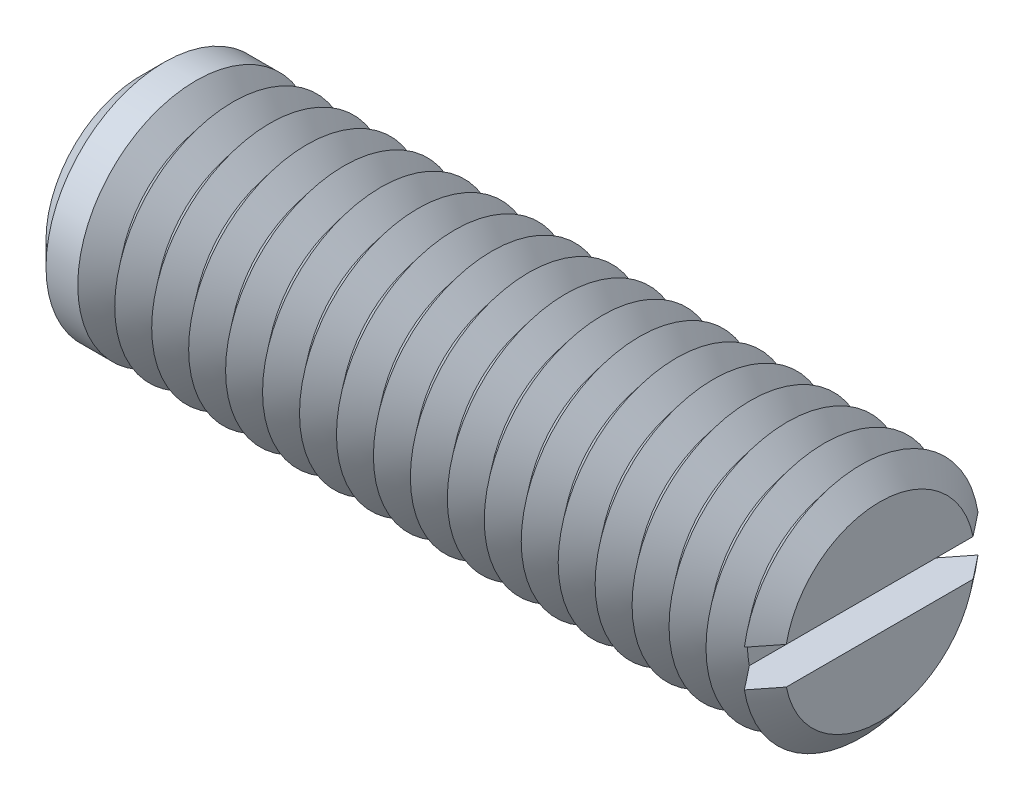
ISO-10303-21;
HEADER;
FILE_DESCRIPTION(('STEP AP214'),'2;1');
FILE_NAME('part.step','',(''),(''),'','','');
FILE_SCHEMA(('AUTOMOTIVE_DESIGN { 1 0 10303 214 1 1 1 1 }'));
ENDSEC;
DATA;
#1=APPLICATION_CONTEXT('core data for automotive mechanical design processes');
#2=APPLICATION_PROTOCOL_DEFINITION('international standard','automotive_design',2000,#1);
#3=PRODUCT_CONTEXT('',#1,'mechanical');
#4=PRODUCT('Part','Part','',(#3));
#5=PRODUCT_RELATED_PRODUCT_CATEGORY('part','',(#4));
#6=PRODUCT_DEFINITION_FORMATION('','',#4);
#7=PRODUCT_DEFINITION_CONTEXT('part definition',#1,'design');
#8=PRODUCT_DEFINITION('design','',#6,#7);
#9=PRODUCT_DEFINITION_SHAPE('','',#8);
#10=(LENGTH_UNIT() NAMED_UNIT(*) SI_UNIT(.MILLI.,.METRE.));
#11=(NAMED_UNIT(*) PLANE_ANGLE_UNIT() SI_UNIT($,.RADIAN.));
#12=(NAMED_UNIT(*) SI_UNIT($,.STERADIAN.) SOLID_ANGLE_UNIT());
#13=UNCERTAINTY_MEASURE_WITH_UNIT(LENGTH_MEASURE(1.E-05),#10,'distance_accuracy_value','');
#14=(GEOMETRIC_REPRESENTATION_CONTEXT(3) GLOBAL_UNCERTAINTY_ASSIGNED_CONTEXT((#13)) GLOBAL_UNIT_ASSIGNED_CONTEXT((#10,
#11,#12)) REPRESENTATION_CONTEXT('',''));
#15=CARTESIAN_POINT('',(0.,0.,0.));
#16=DIRECTION('',(0.,0.,1.));
#17=DIRECTION('',(1.,0.,0.));
#18=AXIS2_PLACEMENT_3D('',#15,#16,#17);
#19=CARTESIAN_POINT('',(11.875,0.,0.));
#20=DIRECTION('',(1.,0.,0.));
#21=DIRECTION('',(0.,0.,-1.));
#22=AXIS2_PLACEMENT_3D('',#19,#20,#21);
#23=CONICAL_SURFACE('',#22,4.,0.895664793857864);
#24=CARTESIAN_POINT('',(11.875,0.,0.));
#25=DIRECTION('',(-1.,0.,0.));
#26=DIRECTION('',(0.,0.,1.));
#27=AXIS2_PLACEMENT_3D('',#24,#25,#26);
#28=CIRCLE('',#27,4.);
#29=CARTESIAN_POINT('',(11.875,-0.625000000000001,-3.95087015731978));
#30=VERTEX_POINT('',#29);
#31=CARTESIAN_POINT('',(11.875,-0.625000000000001,3.95087015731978));
#32=VERTEX_POINT('',#31);
#33=EDGE_CURVE('E117',#30,#32,#28,.T.);
#34=ORIENTED_EDGE('',*,*,#33,.T.);
#35=CARTESIAN_POINT('',(15.6614902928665,-0.625000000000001,-8.70692181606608));
#36=CARTESIAN_POINT('',(15.4148555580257,-0.625000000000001,-8.39807520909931));
#37=CARTESIAN_POINT('',(15.1682552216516,-0.625000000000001,-8.08920109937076));
#38=CARTESIAN_POINT('',(14.6751408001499,-0.625000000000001,-7.47132164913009));
#39=CARTESIAN_POINT('',(14.4286267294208,-0.625000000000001,-7.16231629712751));
#40=CARTESIAN_POINT('',(13.9351922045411,-0.625000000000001,-6.54345822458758));
#41=CARTESIAN_POINT('',(13.6882721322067,-0.625000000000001,-6.23360519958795));
#42=CARTESIAN_POINT('',(13.1947157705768,-0.625000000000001,-5.61373487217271));
#43=CARTESIAN_POINT('',(12.9480794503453,-0.625000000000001,-5.30371759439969));
#44=CARTESIAN_POINT('',(12.5704817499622,-0.625000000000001,-4.82841623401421));
#45=CARTESIAN_POINT('',(12.4393680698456,-0.625000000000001,-4.66325315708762));
#46=CARTESIAN_POINT('',(12.1773052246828,-0.625000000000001,-4.33279290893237));
#47=CARTESIAN_POINT('',(12.0463560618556,-0.625000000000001,-4.16749573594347));
#48=CARTESIAN_POINT('',(11.7846416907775,-0.625000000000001,-3.83665276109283));
#49=CARTESIAN_POINT('',(11.6538765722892,-0.625000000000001,-3.67110688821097));
#50=CARTESIAN_POINT('',(11.392697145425,-0.625000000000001,-3.33975147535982));
#51=CARTESIAN_POINT('',(11.2622828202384,-0.625000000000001,-3.17394194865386));
#52=CARTESIAN_POINT('',(11.0022082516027,-0.625000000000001,-2.84217045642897));
#53=CARTESIAN_POINT('',(10.8725471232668,-0.625000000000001,-2.6762091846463));
#54=CARTESIAN_POINT('',(10.6140928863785,-0.625000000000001,-2.34356113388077));
#55=CARTESIAN_POINT('',(10.485299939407,-0.625000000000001,-2.17687422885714));
#56=CARTESIAN_POINT('',(10.2934479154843,-0.625000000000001,-1.92591523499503));
#57=CARTESIAN_POINT('',(10.2297426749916,-0.625000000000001,-1.84213757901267));
#58=CARTESIAN_POINT('',(10.1029724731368,-0.625000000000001,-1.67409978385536));
#59=CARTESIAN_POINT('',(10.0399075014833,-0.625000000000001,-1.58983965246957));
#60=CARTESIAN_POINT('',(9.91477855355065,-0.625000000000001,-1.42061659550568));
#61=CARTESIAN_POINT('',(9.85271429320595,-0.625000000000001,-1.33565388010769));
#62=CARTESIAN_POINT('',(9.73018818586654,-0.625000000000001,-1.16458302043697));
#63=CARTESIAN_POINT('',(9.6697261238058,-0.625000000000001,-1.0784750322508));
#64=CARTESIAN_POINT('',(9.59768384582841,-0.625000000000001,-0.972092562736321));
#65=CARTESIAN_POINT('',(9.58470248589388,-0.625000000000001,-0.952767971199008));
#66=CARTESIAN_POINT('',(9.55891286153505,-0.625000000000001,-0.914003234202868));
#67=CARTESIAN_POINT('',(9.54610460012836,-0.625000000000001,-0.894563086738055));
#68=CARTESIAN_POINT('',(9.5079767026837,-0.625000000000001,-0.836043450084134));
#69=CARTESIAN_POINT('',(9.48295601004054,-0.625000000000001,-0.79676778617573));
#70=CARTESIAN_POINT('',(9.43397761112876,-0.625000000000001,-0.717444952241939));
#71=CARTESIAN_POINT('',(9.41002216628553,-0.625000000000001,-0.677396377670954));
#72=CARTESIAN_POINT('',(9.36372075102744,-0.625000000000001,-0.596377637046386));
#73=CARTESIAN_POINT('',(9.34137449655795,-0.625000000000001,-0.555407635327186));
#74=CARTESIAN_POINT('',(9.30599525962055,-0.625000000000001,-0.485816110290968));
#75=CARTESIAN_POINT('',(9.29230494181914,-0.625000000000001,-0.457533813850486));
#76=CARTESIAN_POINT('',(9.26637899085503,-0.625000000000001,-0.40031377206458));
#77=CARTESIAN_POINT('',(9.25414380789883,-0.625000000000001,-0.371375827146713));
#78=CARTESIAN_POINT('',(9.22043044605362,-0.625000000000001,-0.283641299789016));
#79=CARTESIAN_POINT('',(9.20177740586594,-0.625000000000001,-0.223617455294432));
#80=CARTESIAN_POINT('',(9.1847644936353,-0.625000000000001,-0.139102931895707));
#81=CARTESIAN_POINT('',(9.18099555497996,-0.625000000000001,-0.115688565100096));
#82=CARTESIAN_POINT('',(9.17550045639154,-0.625000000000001,-0.0686260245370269));
#83=CARTESIAN_POINT('',(9.17377325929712,-0.625000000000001,-0.0449779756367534));
#84=CARTESIAN_POINT('',(9.1724835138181,-0.625000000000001,0.00234331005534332));
#85=CARTESIAN_POINT('',(9.17291775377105,-0.625000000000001,0.0260164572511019));
#86=CARTESIAN_POINT('',(9.17590637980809,-0.625000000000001,0.0732268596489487));
#87=CARTESIAN_POINT('',(9.17846117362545,-0.625000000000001,0.0967640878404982));
#88=CARTESIAN_POINT('',(9.19140028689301,-0.625000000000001,0.182271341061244));
#89=CARTESIAN_POINT('',(9.20774463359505,-0.625000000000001,0.243366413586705));
#90=CARTESIAN_POINT('',(9.23888875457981,-0.625000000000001,0.332669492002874));
#91=CARTESIAN_POINT('',(9.25044197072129,-0.625000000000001,0.362174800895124));
#92=CARTESIAN_POINT('',(9.2752210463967,-0.625000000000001,0.420481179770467));
#93=CARTESIAN_POINT('',(9.28844644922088,-0.625000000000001,0.449282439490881));
#94=CARTESIAN_POINT('',(9.31746779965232,-0.625000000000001,0.508972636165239));
#95=CARTESIAN_POINT('',(9.33338859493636,-0.625000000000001,0.53979966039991));
#96=CARTESIAN_POINT('',(9.36634259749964,-0.625000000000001,0.600856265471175));
#97=CARTESIAN_POINT('',(9.38337598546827,-0.625000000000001,0.631085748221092));
#98=CARTESIAN_POINT('',(9.43573486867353,-0.625000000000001,0.721100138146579));
#99=CARTESIAN_POINT('',(9.47229481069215,-0.625000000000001,0.780163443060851));
#100=CARTESIAN_POINT('',(9.54742966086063,-0.625000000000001,0.897183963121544));
#101=CARTESIAN_POINT('',(9.58600946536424,-0.625000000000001,0.955137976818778));
#102=CARTESIAN_POINT('',(9.66440967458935,-0.625000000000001,1.0702065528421));
#103=CARTESIAN_POINT('',(9.70423020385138,-0.625000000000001,1.12732103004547));
#104=CARTESIAN_POINT('',(9.78478419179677,-0.625000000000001,1.24108525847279));
#105=CARTESIAN_POINT('',(9.82551943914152,-0.625000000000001,1.29773373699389));
#106=CARTESIAN_POINT('',(9.90757809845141,-0.625000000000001,1.4106117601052));
#107=CARTESIAN_POINT('',(9.94890157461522,-0.625000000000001,1.46684125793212));
#108=CARTESIAN_POINT('',(10.0733456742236,-0.625000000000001,1.63486189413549));
#109=CARTESIAN_POINT('',(10.1570882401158,-0.625000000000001,1.74619171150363));
#110=CARTESIAN_POINT('',(10.3245788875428,-0.625000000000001,1.9669036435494));
#111=CARTESIAN_POINT('',(10.4083166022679,-0.625000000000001,2.07629366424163));
#112=CARTESIAN_POINT('',(10.5763821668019,-0.625000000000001,2.29462016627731));
#113=CARTESIAN_POINT('',(10.6607100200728,-0.625000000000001,2.4035566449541));
#114=CARTESIAN_POINT('',(10.9142762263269,-0.625000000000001,2.7299253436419));
#115=CARTESIAN_POINT('',(11.0840912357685,-0.625000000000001,2.94690900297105));
#116=CARTESIAN_POINT('',(11.4246141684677,-0.625000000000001,3.38042406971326));
#117=CARTESIAN_POINT('',(11.595322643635,-0.625000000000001,3.59695504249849));
#118=CARTESIAN_POINT('',(11.9371950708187,-0.625000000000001,4.02965109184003));
#119=CARTESIAN_POINT('',(12.1083590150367,-0.625000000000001,4.24581617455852));
#120=CARTESIAN_POINT('',(12.4504500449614,-0.625000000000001,4.67725748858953));
#121=CARTESIAN_POINT('',(12.6213762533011,-0.625000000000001,4.89253441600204));
#122=CARTESIAN_POINT('',(12.9634226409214,-0.625000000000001,5.32293566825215));
#123=CARTESIAN_POINT('',(13.1345428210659,-0.625000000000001,5.53805999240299));
#124=CARTESIAN_POINT('',(13.6480384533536,-0.625000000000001,6.18319284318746));
#125=CARTESIAN_POINT('',(13.9906134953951,-0.625000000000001,6.61304248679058));
#126=CARTESIAN_POINT('',(14.4438892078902,-0.625000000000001,7.18140561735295));
#127=CARTESIAN_POINT('',(14.5544613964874,-0.625000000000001,7.3200216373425));
#128=CARTESIAN_POINT('',(14.7756363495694,-0.625000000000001,7.59723760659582));
#129=CARTESIAN_POINT('',(14.886239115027,-0.625000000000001,7.7358375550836));
#130=CARTESIAN_POINT('',(15.1076076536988,-0.625000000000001,8.01319622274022));
#131=CARTESIAN_POINT('',(15.2183734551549,-0.625000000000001,8.15195491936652));
#132=CARTESIAN_POINT('',(15.439920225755,-0.625000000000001,8.42945184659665));
#133=CARTESIAN_POINT('',(15.5507011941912,-0.625000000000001,8.56819007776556));
#134=CARTESIAN_POINT('',(15.6614902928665,-0.625000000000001,8.70692181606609));
#135=B_SPLINE_CURVE_WITH_KNOTS('',3,(#35,#36,#37,#38,#39,#40,#41,#42,#43,#44,#45,#46,#47,#48,
#49,#50,#51,#52,#53,#54,#55,#56,#57,#58,#59,#60,#61,#62,#63,#64,#65,#66,#67,#68,#69,#70,#71,#72,
#73,#74,#75,#76,#77,#78,#79,#80,#81,#82,#83,#84,#85,#86,#87,#88,#89,#90,#91,#92,#93,#94,#95,#96,
#97,#98,#99,#100,#101,#102,#103,#104,#105,#106,#107,#108,#109,#110,#111,#112,#113,#114,#115,
#116,#117,#118,#119,#120,#121,#122,#123,#124,#125,#126,#127,#128,#129,#130,#131,#132,#133,#134),
.UNSPECIFIED.,.F.,.F.,(4,2,2,2,2,2,2,2,2,2,2,2,2,2,2,2,2,2,2,2,2,2,2,2,2,2,2,2,2,2,2,2,2,2,2,2,
2,2,2,2,2,2,2,2,2,2,2,2,2,4),(0.,1.18572103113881,2.37158837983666,3.5602033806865,
4.7486734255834,5.38130812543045,6.01395126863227,6.646836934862,7.27969171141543,
7.91151062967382,8.54344406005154,8.85918511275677,9.17492108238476,9.49056578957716,
9.8061679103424,9.8760068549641,9.94584701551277,10.0855382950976,10.2255132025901,
10.3654633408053,10.4596856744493,10.5539370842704,10.741396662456,10.8124690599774,
10.8835053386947,10.9544360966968,11.0253804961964,11.2137597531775,11.3088096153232,
11.403833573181,11.5078935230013,11.6119704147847,11.8202840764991,12.0291284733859,
12.2379939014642,12.4473111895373,12.6566515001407,13.0745694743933,13.4878513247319,
13.9011356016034,14.7277337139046,15.5549232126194,16.3820986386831,17.2067434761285,
18.0313920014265,19.6803778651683,20.2123228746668,20.7442873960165,21.2769292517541,
21.8095515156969),.UNSPECIFIED.);
#136=CARTESIAN_POINT('',(11.25,-0.625000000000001,3.1581247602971));
#137=VERTEX_POINT('',#136);
#138=EDGE_CURVE('E109',#137,#32,#135,.T.);
#139=ORIENTED_EDGE('',*,*,#138,.F.);
#140=CARTESIAN_POINT('',(11.25,0.,0.));
#141=DIRECTION('',(-1.,0.,0.));
#142=DIRECTION('',(0.,0.,1.));
#143=AXIS2_PLACEMENT_3D('',#140,#141,#142);
#144=CIRCLE('',#143,3.2193752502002);
#145=CARTESIAN_POINT('',(11.25,-0.625000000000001,-3.1581247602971));
#146=VERTEX_POINT('',#145);
#147=EDGE_CURVE('E368',#146,#137,#144,.T.);
#148=ORIENTED_EDGE('',*,*,#147,.F.);
#149=EDGE_CURVE('E58',#30,#146,#135,.T.);
#150=ORIENTED_EDGE('',*,*,#149,.F.);
#151=EDGE_LOOP('',(#34,#139,#148,#150));
#152=FACE_BOUND('',#151,.T.);
#153=ADVANCED_FACE('F37',(#152),#23,.T.);
#154=CARTESIAN_POINT('',(11.875,0.625000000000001,3.95087015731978));
#155=VERTEX_POINT('',#154);
#156=CARTESIAN_POINT('',(11.875,0.625000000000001,-3.95087015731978));
#157=VERTEX_POINT('',#156);
#158=EDGE_CURVE('E100',#155,#157,#28,.T.);
#159=ORIENTED_EDGE('',*,*,#158,.T.);
#160=CARTESIAN_POINT('',(15.6614902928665,0.625000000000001,8.70692181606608));
#161=CARTESIAN_POINT('',(15.4148555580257,0.625000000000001,8.39807520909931));
#162=CARTESIAN_POINT('',(15.1682552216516,0.625000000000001,8.08920109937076));
#163=CARTESIAN_POINT('',(14.6751408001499,0.625000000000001,7.47132164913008));
#164=CARTESIAN_POINT('',(14.4286267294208,0.625000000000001,7.1623162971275));
#165=CARTESIAN_POINT('',(13.9351922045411,0.625000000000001,6.54345822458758));
#166=CARTESIAN_POINT('',(13.6882721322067,0.625000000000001,6.23360519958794));
#167=CARTESIAN_POINT('',(13.1947157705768,0.625000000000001,5.6137348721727));
#168=CARTESIAN_POINT('',(12.9480794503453,0.625000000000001,5.30371759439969));
#169=CARTESIAN_POINT('',(12.5704817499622,0.625000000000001,4.8284162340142));
#170=CARTESIAN_POINT('',(12.4393680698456,0.625000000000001,4.66325315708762));
#171=CARTESIAN_POINT('',(12.1773052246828,0.625000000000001,4.33279290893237));
#172=CARTESIAN_POINT('',(12.0463560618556,0.625000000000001,4.16749573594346));
#173=CARTESIAN_POINT('',(11.7846416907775,0.625000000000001,3.83665276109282));
#174=CARTESIAN_POINT('',(11.6538765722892,0.625000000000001,3.67110688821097));
#175=CARTESIAN_POINT('',(11.392697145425,0.625000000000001,3.33975147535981));
#176=CARTESIAN_POINT('',(11.2622828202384,0.625000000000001,3.17394194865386));
#177=CARTESIAN_POINT('',(11.0022082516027,0.625000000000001,2.84217045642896));
#178=CARTESIAN_POINT('',(10.8725471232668,0.625000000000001,2.67620918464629));
#179=CARTESIAN_POINT('',(10.6140928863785,0.625000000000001,2.34356113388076));
#180=CARTESIAN_POINT('',(10.485299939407,0.625000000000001,2.17687422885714));
#181=CARTESIAN_POINT('',(10.2934479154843,0.625000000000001,1.92591523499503));
#182=CARTESIAN_POINT('',(10.2297426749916,0.625000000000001,1.84213757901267));
#183=CARTESIAN_POINT('',(10.1029724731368,0.625000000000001,1.67409978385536));
#184=CARTESIAN_POINT('',(10.0399075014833,0.625000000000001,1.58983965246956));
#185=CARTESIAN_POINT('',(9.91477855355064,0.625000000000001,1.42061659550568));
#186=CARTESIAN_POINT('',(9.85271429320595,0.625000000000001,1.33565388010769));
#187=CARTESIAN_POINT('',(9.73018818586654,0.625000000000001,1.16458302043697));
#188=CARTESIAN_POINT('',(9.6697261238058,0.625000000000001,1.0784750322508));
#189=CARTESIAN_POINT('',(9.59768384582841,0.625000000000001,0.972092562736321));
#190=CARTESIAN_POINT('',(9.58470248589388,0.625000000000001,0.952767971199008));
#191=CARTESIAN_POINT('',(9.55891286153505,0.625000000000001,0.914003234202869));
#192=CARTESIAN_POINT('',(9.54610460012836,0.625000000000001,0.894563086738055));
#193=CARTESIAN_POINT('',(9.5079767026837,0.625000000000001,0.836043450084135));
#194=CARTESIAN_POINT('',(9.48295601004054,0.625000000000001,0.796767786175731));
#195=CARTESIAN_POINT('',(9.43397761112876,0.625000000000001,0.71744495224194));
#196=CARTESIAN_POINT('',(9.41002216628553,0.625000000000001,0.677396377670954));
#197=CARTESIAN_POINT('',(9.36372075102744,0.625000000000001,0.596377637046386));
#198=CARTESIAN_POINT('',(9.34137449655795,0.625000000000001,0.555407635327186));
#199=CARTESIAN_POINT('',(9.30599525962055,0.625000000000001,0.485816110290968));
#200=CARTESIAN_POINT('',(9.29230494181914,0.625000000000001,0.457533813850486));
#201=CARTESIAN_POINT('',(9.26637899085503,0.625000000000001,0.400313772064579));
#202=CARTESIAN_POINT('',(9.25414380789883,0.625000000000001,0.371375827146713));
#203=CARTESIAN_POINT('',(9.22043044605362,0.625000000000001,0.283641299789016));
#204=CARTESIAN_POINT('',(9.20177740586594,0.625000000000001,0.223617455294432));
#205=CARTESIAN_POINT('',(9.1847644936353,0.625000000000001,0.139102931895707));
#206=CARTESIAN_POINT('',(9.18099555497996,0.625000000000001,0.115688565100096));
#207=CARTESIAN_POINT('',(9.17550045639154,0.625000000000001,0.0686260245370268));
#208=CARTESIAN_POINT('',(9.17377325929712,0.625000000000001,0.0449779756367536));
#209=CARTESIAN_POINT('',(9.1724835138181,0.625000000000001,-0.00234331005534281));
#210=CARTESIAN_POINT('',(9.17291775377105,0.625000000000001,-0.0260164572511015));
#211=CARTESIAN_POINT('',(9.17590637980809,0.625000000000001,-0.0732268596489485));
#212=CARTESIAN_POINT('',(9.17846117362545,0.625000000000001,-0.0967640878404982));
#213=CARTESIAN_POINT('',(9.19140028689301,0.625000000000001,-0.182271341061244));
#214=CARTESIAN_POINT('',(9.20774463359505,0.625000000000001,-0.243366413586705));
#215=CARTESIAN_POINT('',(9.23888875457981,0.625000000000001,-0.332669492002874));
#216=CARTESIAN_POINT('',(9.25044197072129,0.625000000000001,-0.362174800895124));
#217=CARTESIAN_POINT('',(9.2752210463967,0.625000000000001,-0.420481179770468));
#218=CARTESIAN_POINT('',(9.28844644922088,0.625000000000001,-0.449282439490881));
#219=CARTESIAN_POINT('',(9.31746779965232,0.625000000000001,-0.508972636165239));
#220=CARTESIAN_POINT('',(9.33338859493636,0.625000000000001,-0.53979966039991));
#221=CARTESIAN_POINT('',(9.36634259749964,0.625000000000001,-0.600856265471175));
#222=CARTESIAN_POINT('',(9.38337598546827,0.625000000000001,-0.631085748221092));
#223=CARTESIAN_POINT('',(9.43573486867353,0.625000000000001,-0.721100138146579));
#224=CARTESIAN_POINT('',(9.47229481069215,0.625000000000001,-0.780163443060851));
#225=CARTESIAN_POINT('',(9.54742966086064,0.625000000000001,-0.897183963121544));
#226=CARTESIAN_POINT('',(9.58600946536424,0.625000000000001,-0.955137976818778));
#227=CARTESIAN_POINT('',(9.66440967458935,0.625000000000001,-1.0702065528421));
#228=CARTESIAN_POINT('',(9.70423020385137,0.625000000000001,-1.12732103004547));
#229=CARTESIAN_POINT('',(9.78478419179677,0.625000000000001,-1.24108525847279));
#230=CARTESIAN_POINT('',(9.82551943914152,0.625000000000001,-1.29773373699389));
#231=CARTESIAN_POINT('',(9.90757809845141,0.625000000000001,-1.4106117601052));
#232=CARTESIAN_POINT('',(9.94890157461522,0.625000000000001,-1.46684125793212));
#233=CARTESIAN_POINT('',(10.0733456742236,0.625000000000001,-1.63486189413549));
#234=CARTESIAN_POINT('',(10.1570882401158,0.625000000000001,-1.74619171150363));
#235=CARTESIAN_POINT('',(10.3245788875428,0.625000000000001,-1.9669036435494));
#236=CARTESIAN_POINT('',(10.4083166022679,0.625000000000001,-2.07629366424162));
#237=CARTESIAN_POINT('',(10.5763821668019,0.625000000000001,-2.29462016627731));
#238=CARTESIAN_POINT('',(10.6607100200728,0.625000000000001,-2.4035566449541));
#239=CARTESIAN_POINT('',(10.9142762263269,0.625000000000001,-2.7299253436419));
#240=CARTESIAN_POINT('',(11.0840912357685,0.625000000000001,-2.94690900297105));
#241=CARTESIAN_POINT('',(11.4246141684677,0.625000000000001,-3.38042406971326));
#242=CARTESIAN_POINT('',(11.595322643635,0.625000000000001,-3.59695504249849));
#243=CARTESIAN_POINT('',(11.9371950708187,0.625000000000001,-4.02965109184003));
#244=CARTESIAN_POINT('',(12.1083590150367,0.625000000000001,-4.24581617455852));
#245=CARTESIAN_POINT('',(12.4504500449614,0.625000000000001,-4.67725748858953));
#246=CARTESIAN_POINT('',(12.6213762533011,0.625000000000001,-4.89253441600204));
#247=CARTESIAN_POINT('',(12.9634226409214,0.625000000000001,-5.32293566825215));
#248=CARTESIAN_POINT('',(13.1345428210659,0.625000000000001,-5.53805999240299));
#249=CARTESIAN_POINT('',(13.6480384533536,0.625000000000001,-6.18319284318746));
#250=CARTESIAN_POINT('',(13.9906134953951,0.625000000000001,-6.61304248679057));
#251=CARTESIAN_POINT('',(14.4438892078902,0.625000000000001,-7.18140561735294));
#252=CARTESIAN_POINT('',(14.5544613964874,0.625000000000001,-7.3200216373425));
#253=CARTESIAN_POINT('',(14.7756363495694,0.625000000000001,-7.59723760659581));
#254=CARTESIAN_POINT('',(14.886239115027,0.625000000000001,-7.7358375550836));
#255=CARTESIAN_POINT('',(15.1076076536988,0.625000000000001,-8.01319622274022));
#256=CARTESIAN_POINT('',(15.2183734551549,0.625000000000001,-8.15195491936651));
#257=CARTESIAN_POINT('',(15.439920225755,0.625000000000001,-8.42945184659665));
#258=CARTESIAN_POINT('',(15.5507011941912,0.625000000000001,-8.56819007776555));
#259=CARTESIAN_POINT('',(15.6614902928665,0.625000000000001,-8.70692181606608));
#260=B_SPLINE_CURVE_WITH_KNOTS('',3,(#160,#161,#162,#163,#164,#165,#166,#167,#168,#169,#170,
#171,#172,#173,#174,#175,#176,#177,#178,#179,#180,#181,#182,#183,#184,#185,#186,#187,#188,#189,
#190,#191,#192,#193,#194,#195,#196,#197,#198,#199,#200,#201,#202,#203,#204,#205,#206,#207,#208,
#209,#210,#211,#212,#213,#214,#215,#216,#217,#218,#219,#220,#221,#222,#223,#224,#225,#226,#227,
#228,#229,#230,#231,#232,#233,#234,#235,#236,#237,#238,#239,#240,#241,#242,#243,#244,#245,#246,
#247,#248,#249,#250,#251,#252,#253,#254,#255,#256,#257,#258,#259),.UNSPECIFIED.,.F.,.F.,(4,2,2,
2,2,2,2,2,2,2,2,2,2,2,2,2,2,2,2,2,2,2,2,2,2,2,2,2,2,2,2,2,2,2,2,2,2,2,2,2,2,2,2,2,2,2,2,2,2,4),
(0.,1.18572103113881,2.37158837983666,3.5602033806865,4.7486734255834,5.38130812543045,
6.01395126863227,6.646836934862,7.27969171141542,7.91151062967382,8.54344406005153,
8.85918511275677,9.17492108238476,9.49056578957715,9.80616791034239,9.87600685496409,
9.94584701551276,10.0855382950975,10.2255132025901,10.3654633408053,10.4596856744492,
10.5539370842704,10.741396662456,10.8124690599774,10.8835053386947,10.9544360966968,
11.0253804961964,11.2137597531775,11.3088096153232,11.403833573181,11.5078935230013,
11.6119704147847,11.8202840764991,12.0291284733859,12.2379939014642,12.4473111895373,
12.6566515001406,13.0745694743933,13.4878513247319,13.9011356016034,14.7277337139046,
15.5549232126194,16.3820986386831,17.2067434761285,18.0313920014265,19.6803778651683,
20.2123228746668,20.7442873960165,21.2769292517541,21.8095515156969),.UNSPECIFIED.);
#261=CARTESIAN_POINT('',(11.25,0.625000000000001,-3.1581247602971));
#262=VERTEX_POINT('',#261);
#263=EDGE_CURVE('E110',#262,#157,#260,.T.);
#264=ORIENTED_EDGE('',*,*,#263,.F.);
#265=CARTESIAN_POINT('',(11.25,0.625000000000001,3.1581247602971));
#266=VERTEX_POINT('',#265);
#267=EDGE_CURVE('E103',#266,#262,#144,.T.);
#268=ORIENTED_EDGE('',*,*,#267,.F.);
#269=EDGE_CURVE('E97',#155,#266,#260,.T.);
#270=ORIENTED_EDGE('',*,*,#269,.F.);
#271=EDGE_LOOP('',(#159,#264,#268,#270));
#272=FACE_BOUND('',#271,.T.);
#273=ADVANCED_FACE('F99',(#272),#23,.T.);
#274=CARTESIAN_POINT('',(11.25,0.,0.));
#275=DIRECTION('',(-1.,0.,0.));
#276=DIRECTION('',(0.,0.,1.));
#277=AXIS2_PLACEMENT_3D('',#274,#275,#276);
#278=CONICAL_SURFACE('',#277,3.2193752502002,0.895664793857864);
#279=CARTESIAN_POINT('',(10.625,0.,0.));
#280=DIRECTION('',(-1.,0.,0.));
#281=DIRECTION('',(0.,0.,1.));
#282=AXIS2_PLACEMENT_3D('',#279,#280,#281);
#283=CIRCLE('',#282,4.);
#284=CARTESIAN_POINT('',(10.625,0.,4.));
#285=VERTEX_POINT('',#284);
#286=EDGE_CURVE('E355',#285,#285,#283,.T.);
#287=ORIENTED_EDGE('',*,*,#286,.F.);
#288=EDGE_LOOP('',(#287));
#289=FACE_BOUND('',#288,.T.);
#290=ORIENTED_EDGE('',*,*,#267,.T.);
#291=EDGE_CURVE('E364',#262,#146,#144,.T.);
#292=ORIENTED_EDGE('',*,*,#291,.T.);
#293=ORIENTED_EDGE('',*,*,#147,.T.);
#294=EDGE_CURVE('E362',#137,#266,#144,.T.);
#295=ORIENTED_EDGE('',*,*,#294,.T.);
#296=EDGE_LOOP('',(#290,#292,#293,#295));
#297=FACE_BOUND('',#296,.T.);
#298=ADVANCED_FACE('F166',(#289,#297),#278,.T.);
#299=CARTESIAN_POINT('',(12.5,0.,0.));
#300=DIRECTION('',(1.,0.,0.));
#301=DIRECTION('',(0.,0.,-1.));
#302=AXIS2_PLACEMENT_3D('',#299,#300,#301);
#303=PLANE('',#302);
#304=CARTESIAN_POINT('',(12.5,0.,0.));
#305=DIRECTION('',(-1.,0.,0.));
#306=DIRECTION('',(0.,0.,1.));
#307=AXIS2_PLACEMENT_3D('',#304,#305,#306);
#308=CIRCLE('',#307,3.2193752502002);
#309=CARTESIAN_POINT('',(12.5,0.625000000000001,3.1581247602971));
#310=VERTEX_POINT('',#309);
#311=CARTESIAN_POINT('',(12.5,0.625000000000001,-3.1581247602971));
#312=VERTEX_POINT('',#311);
#313=EDGE_CURVE('E158',#310,#312,#308,.T.);
#314=ORIENTED_EDGE('',*,*,#313,.F.);
#315=DIRECTION('',(0.,0.,1.));
#316=VECTOR('',#315,1.);
#317=CARTESIAN_POINT('',(12.5,0.625000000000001,0.));
#318=LINE('',#317,#316);
#319=EDGE_CURVE('E122',#312,#310,#318,.T.);
#320=ORIENTED_EDGE('',*,*,#319,.F.);
#321=EDGE_LOOP('',(#314,#320));
#322=FACE_BOUND('',#321,.T.);
#323=ADVANCED_FACE('F170',(#322),#303,.T.);
#324=CARTESIAN_POINT('',(12.5,-0.625000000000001,-3.1581247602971));
#325=VERTEX_POINT('',#324);
#326=CARTESIAN_POINT('',(12.5,-0.625000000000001,3.1581247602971));
#327=VERTEX_POINT('',#326);
#328=EDGE_CURVE('E66',#325,#327,#308,.T.);
#329=ORIENTED_EDGE('',*,*,#328,.F.);
#330=DIRECTION('',(0.,0.,-1.));
#331=VECTOR('',#330,1.);
#332=CARTESIAN_POINT('',(12.5,-0.625000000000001,0.));
#333=LINE('',#332,#331);
#334=EDGE_CURVE('E135',#327,#325,#333,.T.);
#335=ORIENTED_EDGE('',*,*,#334,.F.);
#336=EDGE_LOOP('',(#329,#335));
#337=FACE_BOUND('',#336,.T.);
#338=ADVANCED_FACE('F200',(#337),#303,.T.);
#339=CARTESIAN_POINT('',(12.5,0.,0.));
#340=DIRECTION('',(-1.,0.,0.));
#341=DIRECTION('',(0.,0.,1.));
#342=AXIS2_PLACEMENT_3D('',#339,#340,#341);
#343=CONICAL_SURFACE('',#342,3.2193752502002,0.895664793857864);
#344=ORIENTED_EDGE('',*,*,#158,.F.);
#345=CARTESIAN_POINT('',(8.08850970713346,0.625000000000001,-8.70692181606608));
#346=CARTESIAN_POINT('',(8.33514444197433,0.625000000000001,-8.39807520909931));
#347=CARTESIAN_POINT('',(8.58174477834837,0.625000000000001,-8.08920109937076));
#348=CARTESIAN_POINT('',(9.07485919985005,0.625000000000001,-7.47132164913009));
#349=CARTESIAN_POINT('',(9.32137327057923,0.625000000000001,-7.16231629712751));
#350=CARTESIAN_POINT('',(9.8148077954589,0.625000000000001,-6.54345822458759));
#351=CARTESIAN_POINT('',(10.0617278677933,0.625000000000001,-6.23360519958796));
#352=CARTESIAN_POINT('',(10.5552842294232,0.625000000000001,-5.61373487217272));
#353=CARTESIAN_POINT('',(10.8019205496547,0.625000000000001,-5.30371759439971));
#354=CARTESIAN_POINT('',(11.1795182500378,0.625000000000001,-4.82841623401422));
#355=CARTESIAN_POINT('',(11.3106319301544,0.625000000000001,-4.66325315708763));
#356=CARTESIAN_POINT('',(11.5726947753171,0.625000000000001,-4.33279290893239));
#357=CARTESIAN_POINT('',(11.7036439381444,0.625000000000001,-4.16749573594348));
#358=CARTESIAN_POINT('',(11.9653583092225,0.625000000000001,-3.83665276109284));
#359=CARTESIAN_POINT('',(12.0961234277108,0.625000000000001,-3.67110688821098));
#360=CARTESIAN_POINT('',(12.357302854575,0.625000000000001,-3.33975147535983));
#361=CARTESIAN_POINT('',(12.4877171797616,0.625000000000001,-3.17394194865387));
#362=CARTESIAN_POINT('',(12.7477917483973,0.625000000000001,-2.84217045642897));
#363=CARTESIAN_POINT('',(12.8774528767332,0.625000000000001,-2.6762091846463));
#364=CARTESIAN_POINT('',(13.1359071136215,0.625000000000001,-2.34356113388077));
#365=CARTESIAN_POINT('',(13.264700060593,0.625000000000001,-2.17687422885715));
#366=CARTESIAN_POINT('',(13.4565520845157,0.625000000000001,-1.92591523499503));
#367=CARTESIAN_POINT('',(13.5202573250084,0.625000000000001,-1.84213757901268));
#368=CARTESIAN_POINT('',(13.6470275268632,0.625000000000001,-1.67409978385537));
#369=CARTESIAN_POINT('',(13.7100924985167,0.625000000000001,-1.58983965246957));
#370=CARTESIAN_POINT('',(13.8352214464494,0.625000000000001,-1.42061659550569));
#371=CARTESIAN_POINT('',(13.8972857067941,0.625000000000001,-1.3356538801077));
#372=CARTESIAN_POINT('',(14.0198118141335,0.625000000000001,-1.16458302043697));
#373=CARTESIAN_POINT('',(14.0802738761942,0.625000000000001,-1.0784750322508));
#374=CARTESIAN_POINT('',(14.1523161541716,0.625000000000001,-0.972092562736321));
#375=CARTESIAN_POINT('',(14.1652975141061,0.625000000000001,-0.952767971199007));
#376=CARTESIAN_POINT('',(14.1910871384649,0.625000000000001,-0.914003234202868));
#377=CARTESIAN_POINT('',(14.2038953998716,0.625000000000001,-0.894563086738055));
#378=CARTESIAN_POINT('',(14.2420232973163,0.625000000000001,-0.836043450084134));
#379=CARTESIAN_POINT('',(14.2670439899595,0.625000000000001,-0.796767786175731));
#380=CARTESIAN_POINT('',(14.3160223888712,0.625000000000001,-0.71744495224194));
#381=CARTESIAN_POINT('',(14.3399778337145,0.625000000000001,-0.677396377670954));
#382=CARTESIAN_POINT('',(14.3862792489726,0.625000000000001,-0.596377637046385));
#383=CARTESIAN_POINT('',(14.4086255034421,0.625000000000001,-0.555407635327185));
#384=CARTESIAN_POINT('',(14.4440047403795,0.625000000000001,-0.485816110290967));
#385=CARTESIAN_POINT('',(14.4576950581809,0.625000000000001,-0.457533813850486));
#386=CARTESIAN_POINT('',(14.483621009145,0.625000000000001,-0.40031377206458));
#387=CARTESIAN_POINT('',(14.4958561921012,0.625000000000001,-0.371375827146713));
#388=CARTESIAN_POINT('',(14.5295695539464,0.625000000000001,-0.283641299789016));
#389=CARTESIAN_POINT('',(14.5482225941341,0.625000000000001,-0.223617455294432));
#390=CARTESIAN_POINT('',(14.5652355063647,0.625000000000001,-0.139102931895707));
#391=CARTESIAN_POINT('',(14.56900444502,0.625000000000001,-0.115688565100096));
#392=CARTESIAN_POINT('',(14.5744995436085,0.625000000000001,-0.0686260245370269));
#393=CARTESIAN_POINT('',(14.5762267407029,0.625000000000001,-0.0449779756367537));
#394=CARTESIAN_POINT('',(14.5775164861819,0.625000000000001,0.00234331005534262));
#395=CARTESIAN_POINT('',(14.577082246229,0.625000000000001,0.0260164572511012));
#396=CARTESIAN_POINT('',(14.5740936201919,0.625000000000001,0.0732268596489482));
#397=CARTESIAN_POINT('',(14.5715388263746,0.625000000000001,0.0967640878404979));
#398=CARTESIAN_POINT('',(14.558599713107,0.625000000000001,0.182271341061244));
#399=CARTESIAN_POINT('',(14.542255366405,0.625000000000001,0.243366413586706));
#400=CARTESIAN_POINT('',(14.5111112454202,0.625000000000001,0.332669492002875));
#401=CARTESIAN_POINT('',(14.4995580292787,0.625000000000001,0.362174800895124));
#402=CARTESIAN_POINT('',(14.4747789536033,0.625000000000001,0.420481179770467));
#403=CARTESIAN_POINT('',(14.4615535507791,0.625000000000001,0.449282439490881));
#404=CARTESIAN_POINT('',(14.4325322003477,0.625000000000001,0.508972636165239));
#405=CARTESIAN_POINT('',(14.4166114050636,0.625000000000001,0.53979966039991));
#406=CARTESIAN_POINT('',(14.3836574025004,0.625000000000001,0.600856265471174));
#407=CARTESIAN_POINT('',(14.3666240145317,0.625000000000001,0.631085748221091));
#408=CARTESIAN_POINT('',(14.3142651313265,0.625000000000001,0.721100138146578));
#409=CARTESIAN_POINT('',(14.2777051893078,0.625000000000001,0.78016344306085));
#410=CARTESIAN_POINT('',(14.2025703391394,0.625000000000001,0.897183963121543));
#411=CARTESIAN_POINT('',(14.1639905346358,0.625000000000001,0.955137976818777));
#412=CARTESIAN_POINT('',(14.0855903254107,0.625000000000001,1.0702065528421));
#413=CARTESIAN_POINT('',(14.0457697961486,0.625000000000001,1.12732103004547));
#414=CARTESIAN_POINT('',(13.9652158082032,0.625000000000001,1.24108525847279));
#415=CARTESIAN_POINT('',(13.9244805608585,0.625000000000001,1.29773373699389));
#416=CARTESIAN_POINT('',(13.8424219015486,0.625000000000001,1.4106117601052));
#417=CARTESIAN_POINT('',(13.8010984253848,0.625000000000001,1.46684125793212));
#418=CARTESIAN_POINT('',(13.6766543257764,0.625000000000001,1.63486189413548));
#419=CARTESIAN_POINT('',(13.5929117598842,0.625000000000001,1.74619171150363));
#420=CARTESIAN_POINT('',(13.4254211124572,0.625000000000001,1.9669036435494));
#421=CARTESIAN_POINT('',(13.3416833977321,0.625000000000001,2.07629366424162));
#422=CARTESIAN_POINT('',(13.1736178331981,0.625000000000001,2.29462016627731));
#423=CARTESIAN_POINT('',(13.0892899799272,0.625000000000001,2.4035566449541));
#424=CARTESIAN_POINT('',(12.8357237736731,0.625000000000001,2.7299253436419));
#425=CARTESIAN_POINT('',(12.6659087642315,0.625000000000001,2.94690900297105));
#426=CARTESIAN_POINT('',(12.3253858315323,0.625000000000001,3.38042406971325));
#427=CARTESIAN_POINT('',(12.154677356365,0.625000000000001,3.59695504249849));
#428=CARTESIAN_POINT('',(11.8128049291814,0.625000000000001,4.02965109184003));
#429=CARTESIAN_POINT('',(11.6416409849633,0.625000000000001,4.24581617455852));
#430=CARTESIAN_POINT('',(11.2995499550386,0.625000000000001,4.67725748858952));
#431=CARTESIAN_POINT('',(11.1286237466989,0.625000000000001,4.89253441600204));
#432=CARTESIAN_POINT('',(10.7865773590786,0.625000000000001,5.32293566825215));
#433=CARTESIAN_POINT('',(10.6154571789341,0.625000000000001,5.53805999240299));
#434=CARTESIAN_POINT('',(10.1019615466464,0.625000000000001,6.18319284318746));
#435=CARTESIAN_POINT('',(9.75938650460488,0.625000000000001,6.61304248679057));
#436=CARTESIAN_POINT('',(9.30611079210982,0.625000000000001,7.18140561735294));
#437=CARTESIAN_POINT('',(9.19553860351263,0.625000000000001,7.3200216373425));
#438=CARTESIAN_POINT('',(8.97436365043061,0.625000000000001,7.59723760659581));
#439=CARTESIAN_POINT('',(8.86376088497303,0.625000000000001,7.7358375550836));
#440=CARTESIAN_POINT('',(8.64239234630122,0.625000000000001,8.01319622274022));
#441=CARTESIAN_POINT('',(8.53162654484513,0.625000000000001,8.15195491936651));
#442=CARTESIAN_POINT('',(8.31007977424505,0.625000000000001,8.42945184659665));
#443=CARTESIAN_POINT('',(8.19929880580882,0.625000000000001,8.56819007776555));
#444=CARTESIAN_POINT('',(8.08850970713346,0.625000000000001,8.70692181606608));
#445=B_SPLINE_CURVE_WITH_KNOTS('',3,(#345,#346,#347,#348,#349,#350,#351,#352,#353,#354,#355,
#356,#357,#358,#359,#360,#361,#362,#363,#364,#365,#366,#367,#368,#369,#370,#371,#372,#373,#374,
#375,#376,#377,#378,#379,#380,#381,#382,#383,#384,#385,#386,#387,#388,#389,#390,#391,#392,#393,
#394,#395,#396,#397,#398,#399,#400,#401,#402,#403,#404,#405,#406,#407,#408,#409,#410,#411,#412,
#413,#414,#415,#416,#417,#418,#419,#420,#421,#422,#423,#424,#425,#426,#427,#428,#429,#430,#431,
#432,#433,#434,#435,#436,#437,#438,#439,#440,#441,#442,#443,#444),.UNSPECIFIED.,.F.,.F.,(4,2,2,
2,2,2,2,2,2,2,2,2,2,2,2,2,2,2,2,2,2,2,2,2,2,2,2,2,2,2,2,2,2,2,2,2,2,2,2,2,2,2,2,2,2,2,2,2,2,4),
(0.,1.1857210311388,2.37158837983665,3.56020338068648,4.74867342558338,5.38130812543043,
6.01395126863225,6.64683693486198,7.27969171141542,7.91151062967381,8.54344406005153,
8.85918511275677,9.17492108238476,9.49056578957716,9.8061679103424,9.8760068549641,
9.94584701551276,10.0855382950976,10.2255132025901,10.3654633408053,10.4596856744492,
10.5539370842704,10.741396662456,10.8124690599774,10.8835053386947,10.9544360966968,
11.0253804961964,11.2137597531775,11.3088096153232,11.403833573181,11.5078935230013,
11.6119704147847,11.8202840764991,12.0291284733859,12.2379939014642,12.4473111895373,
12.6566515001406,13.0745694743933,13.4878513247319,13.9011356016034,14.7277337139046,
15.5549232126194,16.3820986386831,17.2067434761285,18.0313920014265,19.6803778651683,
20.2123228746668,20.7442873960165,21.2769292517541,21.8095515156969),.UNSPECIFIED.);
#446=EDGE_CURVE('E41',#310,#155,#445,.T.);
#447=ORIENTED_EDGE('',*,*,#446,.F.);
#448=ORIENTED_EDGE('',*,*,#313,.T.);
#449=EDGE_CURVE('E11',#157,#312,#445,.T.);
#450=ORIENTED_EDGE('',*,*,#449,.F.);
#451=EDGE_LOOP('',(#344,#447,#448,#450));
#452=FACE_BOUND('',#451,.T.);
#453=ADVANCED_FACE('F114',(#452),#343,.T.);
#454=CARTESIAN_POINT('',(12.5,0.625000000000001,-6.));
#455=DIRECTION('',(0.,1.,0.));
#456=DIRECTION('',(0.,0.,1.));
#457=AXIS2_PLACEMENT_3D('',#454,#455,#456);
#458=PLANE('',#457);
#459=ORIENTED_EDGE('',*,*,#446,.T.);
#460=ORIENTED_EDGE('',*,*,#269,.T.);
#461=DIRECTION('',(0.,0.,1.));
#462=VECTOR('',#461,1.);
#463=CARTESIAN_POINT('',(11.25,0.625000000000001,-6.));
#464=LINE('',#463,#462);
#465=EDGE_CURVE('E143',#262,#266,#464,.T.);
#466=ORIENTED_EDGE('',*,*,#465,.F.);
#467=ORIENTED_EDGE('',*,*,#263,.T.);
#468=ORIENTED_EDGE('',*,*,#449,.T.);
#469=ORIENTED_EDGE('',*,*,#319,.T.);
#470=EDGE_LOOP('',(#459,#460,#466,#467,#468,#469));
#471=FACE_BOUND('',#470,.T.);
#472=ADVANCED_FACE('F120',(#471),#458,.F.);
#473=ORIENTED_EDGE('',*,*,#33,.F.);
#474=CARTESIAN_POINT('',(8.08850970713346,-0.625000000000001,8.70692181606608));
#475=CARTESIAN_POINT('',(8.33514444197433,-0.625000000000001,8.39807520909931));
#476=CARTESIAN_POINT('',(8.58174477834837,-0.625000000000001,8.08920109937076));
#477=CARTESIAN_POINT('',(9.07485919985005,-0.625000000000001,7.47132164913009));
#478=CARTESIAN_POINT('',(9.32137327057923,-0.625000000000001,7.16231629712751));
#479=CARTESIAN_POINT('',(9.81480779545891,-0.625000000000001,6.54345822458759));
#480=CARTESIAN_POINT('',(10.0617278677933,-0.625000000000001,6.23360519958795));
#481=CARTESIAN_POINT('',(10.5552842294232,-0.625000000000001,5.61373487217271));
#482=CARTESIAN_POINT('',(10.8019205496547,-0.625000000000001,5.3037175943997));
#483=CARTESIAN_POINT('',(11.1795182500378,-0.625000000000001,4.82841623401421));
#484=CARTESIAN_POINT('',(11.3106319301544,-0.625000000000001,4.66325315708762));
#485=CARTESIAN_POINT('',(11.5726947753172,-0.625000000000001,4.33279290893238));
#486=CARTESIAN_POINT('',(11.7036439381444,-0.625000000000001,4.16749573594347));
#487=CARTESIAN_POINT('',(11.9653583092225,-0.625000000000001,3.83665276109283));
#488=CARTESIAN_POINT('',(12.0961234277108,-0.625000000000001,3.67110688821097));
#489=CARTESIAN_POINT('',(12.357302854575,-0.625000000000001,3.33975147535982));
#490=CARTESIAN_POINT('',(12.4877171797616,-0.625000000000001,3.17394194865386));
#491=CARTESIAN_POINT('',(12.7477917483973,-0.625000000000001,2.84217045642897));
#492=CARTESIAN_POINT('',(12.8774528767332,-0.625000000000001,2.6762091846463));
#493=CARTESIAN_POINT('',(13.1359071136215,-0.625000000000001,2.34356113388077));
#494=CARTESIAN_POINT('',(13.264700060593,-0.625000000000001,2.17687422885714));
#495=CARTESIAN_POINT('',(13.4565520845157,-0.625000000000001,1.92591523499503));
#496=CARTESIAN_POINT('',(13.5202573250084,-0.625000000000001,1.84213757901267));
#497=CARTESIAN_POINT('',(13.6470275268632,-0.625000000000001,1.67409978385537));
#498=CARTESIAN_POINT('',(13.7100924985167,-0.625000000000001,1.58983965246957));
#499=CARTESIAN_POINT('',(13.8352214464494,-0.625000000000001,1.42061659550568));
#500=CARTESIAN_POINT('',(13.8972857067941,-0.625000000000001,1.33565388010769));
#501=CARTESIAN_POINT('',(14.0198118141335,-0.625000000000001,1.16458302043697));
#502=CARTESIAN_POINT('',(14.0802738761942,-0.625000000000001,1.0784750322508));
#503=CARTESIAN_POINT('',(14.1523161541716,-0.625000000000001,0.972092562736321));
#504=CARTESIAN_POINT('',(14.1652975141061,-0.625000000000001,0.952767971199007));
#505=CARTESIAN_POINT('',(14.1910871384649,-0.625000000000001,0.914003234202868));
#506=CARTESIAN_POINT('',(14.2038953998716,-0.625000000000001,0.894563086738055));
#507=CARTESIAN_POINT('',(14.2420232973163,-0.625000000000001,0.836043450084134));
#508=CARTESIAN_POINT('',(14.2670439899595,-0.625000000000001,0.796767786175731));
#509=CARTESIAN_POINT('',(14.3160223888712,-0.625000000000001,0.717444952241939));
#510=CARTESIAN_POINT('',(14.3399778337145,-0.625000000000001,0.677396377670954));
#511=CARTESIAN_POINT('',(14.3862792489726,-0.625000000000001,0.596377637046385));
#512=CARTESIAN_POINT('',(14.4086255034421,-0.625000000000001,0.555407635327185));
#513=CARTESIAN_POINT('',(14.4440047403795,-0.625000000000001,0.485816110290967));
#514=CARTESIAN_POINT('',(14.4576950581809,-0.625000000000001,0.457533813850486));
#515=CARTESIAN_POINT('',(14.483621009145,-0.625000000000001,0.40031377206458));
#516=CARTESIAN_POINT('',(14.4958561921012,-0.625000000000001,0.371375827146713));
#517=CARTESIAN_POINT('',(14.5295695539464,-0.625000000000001,0.283641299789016));
#518=CARTESIAN_POINT('',(14.5482225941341,-0.625000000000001,0.223617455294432));
#519=CARTESIAN_POINT('',(14.5652355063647,-0.625000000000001,0.139102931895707));
#520=CARTESIAN_POINT('',(14.56900444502,-0.625000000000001,0.115688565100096));
#521=CARTESIAN_POINT('',(14.5744995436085,-0.625000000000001,0.068626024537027));
#522=CARTESIAN_POINT('',(14.5762267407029,-0.625000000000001,0.0449779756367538));
#523=CARTESIAN_POINT('',(14.5775164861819,-0.625000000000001,-0.00234331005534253));
#524=CARTESIAN_POINT('',(14.577082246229,-0.625000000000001,-0.0260164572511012));
#525=CARTESIAN_POINT('',(14.5740936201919,-0.625000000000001,-0.0732268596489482));
#526=CARTESIAN_POINT('',(14.5715388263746,-0.625000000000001,-0.0967640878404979));
#527=CARTESIAN_POINT('',(14.558599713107,-0.625000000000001,-0.182271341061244));
#528=CARTESIAN_POINT('',(14.542255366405,-0.625000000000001,-0.243366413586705));
#529=CARTESIAN_POINT('',(14.5111112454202,-0.625000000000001,-0.332669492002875));
#530=CARTESIAN_POINT('',(14.4995580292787,-0.625000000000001,-0.362174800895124));
#531=CARTESIAN_POINT('',(14.4747789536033,-0.625000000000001,-0.420481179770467));
#532=CARTESIAN_POINT('',(14.4615535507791,-0.625000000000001,-0.449282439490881));
#533=CARTESIAN_POINT('',(14.4325322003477,-0.625000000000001,-0.508972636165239));
#534=CARTESIAN_POINT('',(14.4166114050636,-0.625000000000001,-0.539799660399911));
#535=CARTESIAN_POINT('',(14.3836574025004,-0.625000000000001,-0.600856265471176));
#536=CARTESIAN_POINT('',(14.3666240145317,-0.625000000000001,-0.631085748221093));
#537=CARTESIAN_POINT('',(14.3142651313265,-0.625000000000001,-0.721100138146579));
#538=CARTESIAN_POINT('',(14.2777051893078,-0.625000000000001,-0.780163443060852));
#539=CARTESIAN_POINT('',(14.2025703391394,-0.625000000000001,-0.897183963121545));
#540=CARTESIAN_POINT('',(14.1639905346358,-0.625000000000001,-0.955137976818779));
#541=CARTESIAN_POINT('',(14.0855903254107,-0.625000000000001,-1.0702065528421));
#542=CARTESIAN_POINT('',(14.0457697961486,-0.625000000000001,-1.12732103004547));
#543=CARTESIAN_POINT('',(13.9652158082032,-0.625000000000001,-1.24108525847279));
#544=CARTESIAN_POINT('',(13.9244805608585,-0.625000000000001,-1.29773373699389));
#545=CARTESIAN_POINT('',(13.8424219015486,-0.625000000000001,-1.4106117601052));
#546=CARTESIAN_POINT('',(13.8010984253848,-0.625000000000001,-1.46684125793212));
#547=CARTESIAN_POINT('',(13.6766543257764,-0.625000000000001,-1.63486189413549));
#548=CARTESIAN_POINT('',(13.5929117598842,-0.625000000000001,-1.74619171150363));
#549=CARTESIAN_POINT('',(13.4254211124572,-0.625000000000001,-1.9669036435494));
#550=CARTESIAN_POINT('',(13.3416833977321,-0.625000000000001,-2.07629366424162));
#551=CARTESIAN_POINT('',(13.1736178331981,-0.625000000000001,-2.29462016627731));
#552=CARTESIAN_POINT('',(13.0892899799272,-0.625000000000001,-2.4035566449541));
#553=CARTESIAN_POINT('',(12.8357237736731,-0.625000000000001,-2.7299253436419));
#554=CARTESIAN_POINT('',(12.6659087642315,-0.625000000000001,-2.94690900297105));
#555=CARTESIAN_POINT('',(12.3253858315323,-0.625000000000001,-3.38042406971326));
#556=CARTESIAN_POINT('',(12.154677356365,-0.625000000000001,-3.59695504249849));
#557=CARTESIAN_POINT('',(11.8128049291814,-0.625000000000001,-4.02965109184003));
#558=CARTESIAN_POINT('',(11.6416409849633,-0.625000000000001,-4.24581617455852));
#559=CARTESIAN_POINT('',(11.2995499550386,-0.625000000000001,-4.67725748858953));
#560=CARTESIAN_POINT('',(11.1286237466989,-0.625000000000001,-4.89253441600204));
#561=CARTESIAN_POINT('',(10.7865773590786,-0.625000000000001,-5.32293566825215));
#562=CARTESIAN_POINT('',(10.6154571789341,-0.625000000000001,-5.53805999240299));
#563=CARTESIAN_POINT('',(10.1019615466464,-0.625000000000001,-6.18319284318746));
#564=CARTESIAN_POINT('',(9.75938650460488,-0.625000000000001,-6.61304248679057));
#565=CARTESIAN_POINT('',(9.30611079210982,-0.625000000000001,-7.18140561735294));
#566=CARTESIAN_POINT('',(9.19553860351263,-0.625000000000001,-7.3200216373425));
#567=CARTESIAN_POINT('',(8.97436365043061,-0.625000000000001,-7.59723760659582));
#568=CARTESIAN_POINT('',(8.86376088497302,-0.625000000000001,-7.7358375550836));
#569=CARTESIAN_POINT('',(8.64239234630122,-0.625000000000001,-8.01319622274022));
#570=CARTESIAN_POINT('',(8.53162654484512,-0.625000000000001,-8.15195491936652));
#571=CARTESIAN_POINT('',(8.31007977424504,-0.625000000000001,-8.42945184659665));
#572=CARTESIAN_POINT('',(8.19929880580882,-0.625000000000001,-8.56819007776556));
#573=CARTESIAN_POINT('',(8.08850970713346,-0.625000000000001,-8.70692181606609));
#574=B_SPLINE_CURVE_WITH_KNOTS('',3,(#474,#475,#476,#477,#478,#479,#480,#481,#482,#483,#484,
#485,#486,#487,#488,#489,#490,#491,#492,#493,#494,#495,#496,#497,#498,#499,#500,#501,#502,#503,
#504,#505,#506,#507,#508,#509,#510,#511,#512,#513,#514,#515,#516,#517,#518,#519,#520,#521,#522,
#523,#524,#525,#526,#527,#528,#529,#530,#531,#532,#533,#534,#535,#536,#537,#538,#539,#540,#541,
#542,#543,#544,#545,#546,#547,#548,#549,#550,#551,#552,#553,#554,#555,#556,#557,#558,#559,#560,
#561,#562,#563,#564,#565,#566,#567,#568,#569,#570,#571,#572,#573),.UNSPECIFIED.,.F.,.F.,(4,2,2,
2,2,2,2,2,2,2,2,2,2,2,2,2,2,2,2,2,2,2,2,2,2,2,2,2,2,2,2,2,2,2,2,2,2,2,2,2,2,2,2,2,2,2,2,2,2,4),
(0.,1.18572103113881,2.37158837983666,3.5602033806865,4.74867342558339,5.38130812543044,
6.01395126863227,6.64683693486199,7.27969171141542,7.91151062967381,8.54344406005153,
8.85918511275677,9.17492108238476,9.49056578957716,9.8061679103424,9.8760068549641,
9.94584701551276,10.0855382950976,10.2255132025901,10.3654633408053,10.4596856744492,
10.5539370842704,10.741396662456,10.8124690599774,10.8835053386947,10.9544360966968,
11.0253804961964,11.2137597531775,11.3088096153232,11.403833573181,11.5078935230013,
11.6119704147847,11.8202840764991,12.0291284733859,12.2379939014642,12.4473111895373,
12.6566515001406,13.0745694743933,13.4878513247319,13.9011356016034,14.7277337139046,
15.5549232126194,16.3820986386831,17.2067434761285,18.0313920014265,19.6803778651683,
20.2123228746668,20.7442873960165,21.2769292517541,21.8095515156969),.UNSPECIFIED.);
#575=EDGE_CURVE('E150',#325,#30,#574,.T.);
#576=ORIENTED_EDGE('',*,*,#575,.F.);
#577=ORIENTED_EDGE('',*,*,#328,.T.);
#578=EDGE_CURVE('E146',#32,#327,#574,.T.);
#579=ORIENTED_EDGE('',*,*,#578,.F.);
#580=EDGE_LOOP('',(#473,#576,#577,#579));
#581=FACE_BOUND('',#580,.T.);
#582=ADVANCED_FACE('F162',(#581),#343,.T.);
#583=CARTESIAN_POINT('',(12.5,-0.625000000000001,-6.));
#584=DIRECTION('',(0.,-1.,0.));
#585=DIRECTION('',(0.,0.,-1.));
#586=AXIS2_PLACEMENT_3D('',#583,#584,#585);
#587=PLANE('',#586);
#588=ORIENTED_EDGE('',*,*,#575,.T.);
#589=ORIENTED_EDGE('',*,*,#149,.T.);
#590=DIRECTION('',(0.,0.,1.));
#591=VECTOR('',#590,1.);
#592=CARTESIAN_POINT('',(11.25,-0.625000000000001,-6.));
#593=LINE('',#592,#591);
#594=EDGE_CURVE('E142',#146,#137,#593,.T.);
#595=ORIENTED_EDGE('',*,*,#594,.T.);
#596=ORIENTED_EDGE('',*,*,#138,.T.);
#597=ORIENTED_EDGE('',*,*,#578,.T.);
#598=ORIENTED_EDGE('',*,*,#334,.T.);
#599=EDGE_LOOP('',(#588,#589,#595,#596,#597,#598));
#600=FACE_BOUND('',#599,.T.);
#601=ADVANCED_FACE('F159',(#600),#587,.F.);
#602=CARTESIAN_POINT('',(11.25,0.625000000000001,-6.));
#603=DIRECTION('',(-1.,0.,0.));
#604=DIRECTION('',(0.,0.,1.));
#605=AXIS2_PLACEMENT_3D('',#602,#603,#604);
#606=PLANE('',#605);
#607=ORIENTED_EDGE('',*,*,#594,.F.);
#608=ORIENTED_EDGE('',*,*,#291,.F.);
#609=ORIENTED_EDGE('',*,*,#465,.T.);
#610=ORIENTED_EDGE('',*,*,#294,.F.);
#611=EDGE_LOOP('',(#607,#608,#609,#610));
#612=FACE_BOUND('',#611,.T.);
#613=ADVANCED_FACE('F372',(#612),#606,.F.);
#614=CARTESIAN_POINT('',(10.,0.,0.));
#615=DIRECTION('',(-1.,0.,0.));
#616=DIRECTION('',(0.,0.,1.));
#617=AXIS2_PLACEMENT_3D('',#614,#615,#616);
#618=CONICAL_SURFACE('',#617,3.2193752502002,0.895664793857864);
#619=CARTESIAN_POINT('',(9.375,0.,0.));
#620=DIRECTION('',(-1.,0.,0.));
#621=DIRECTION('',(0.,0.,1.));
#622=AXIS2_PLACEMENT_3D('',#619,#620,#621);
#623=CIRCLE('',#622,4.);
#624=CARTESIAN_POINT('',(9.375,0.,4.));
#625=VERTEX_POINT('',#624);
#626=EDGE_CURVE('E347',#625,#625,#623,.T.);
#627=ORIENTED_EDGE('',*,*,#626,.F.);
#628=EDGE_LOOP('',(#627));
#629=FACE_BOUND('',#628,.T.);
#630=CARTESIAN_POINT('',(10.,0.,0.));
#631=DIRECTION('',(-1.,0.,0.));
#632=DIRECTION('',(0.,0.,1.));
#633=AXIS2_PLACEMENT_3D('',#630,#631,#632);
#634=CIRCLE('',#633,3.2193752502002);
#635=CARTESIAN_POINT('',(10.,0.,3.2193752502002));
#636=VERTEX_POINT('',#635);
#637=EDGE_CURVE('E359',#636,#636,#634,.T.);
#638=ORIENTED_EDGE('',*,*,#637,.T.);
#639=EDGE_LOOP('',(#638));
#640=FACE_BOUND('',#639,.T.);
#641=ADVANCED_FACE('F175',(#629,#640),#618,.T.);
#642=CARTESIAN_POINT('',(10.625,0.,0.));
#643=DIRECTION('',(1.,0.,0.));
#644=DIRECTION('',(0.,0.,-1.));
#645=AXIS2_PLACEMENT_3D('',#642,#643,#644);
#646=CONICAL_SURFACE('',#645,4.,0.895664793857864);
#647=ORIENTED_EDGE('',*,*,#637,.F.);
#648=EDGE_LOOP('',(#647));
#649=FACE_BOUND('',#648,.T.);
#650=ORIENTED_EDGE('',*,*,#286,.T.);
#651=EDGE_LOOP('',(#650));
#652=FACE_BOUND('',#651,.T.);
#653=ADVANCED_FACE('F378',(#649,#652),#646,.T.);
#654=CARTESIAN_POINT('',(8.75,0.,0.));
#655=DIRECTION('',(-1.,0.,0.));
#656=DIRECTION('',(0.,0.,1.));
#657=AXIS2_PLACEMENT_3D('',#654,#655,#656);
#658=CONICAL_SURFACE('',#657,3.2193752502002,0.895664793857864);
#659=CARTESIAN_POINT('',(8.125,0.,0.));
#660=DIRECTION('',(-1.,0.,0.));
#661=DIRECTION('',(0.,0.,1.));
#662=AXIS2_PLACEMENT_3D('',#659,#660,#661);
#663=CIRCLE('',#662,4.);
#664=CARTESIAN_POINT('',(8.125,0.,4.));
#665=VERTEX_POINT('',#664);
#666=EDGE_CURVE('E339',#665,#665,#663,.T.);
#667=ORIENTED_EDGE('',*,*,#666,.F.);
#668=EDGE_LOOP('',(#667));
#669=FACE_BOUND('',#668,.T.);
#670=CARTESIAN_POINT('',(8.75,0.,0.));
#671=DIRECTION('',(-1.,0.,0.));
#672=DIRECTION('',(0.,0.,1.));
#673=AXIS2_PLACEMENT_3D('',#670,#671,#672);
#674=CIRCLE('',#673,3.2193752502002);
#675=CARTESIAN_POINT('',(8.75,0.,3.2193752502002));
#676=VERTEX_POINT('',#675);
#677=EDGE_CURVE('E351',#676,#676,#674,.T.);
#678=ORIENTED_EDGE('',*,*,#677,.T.);
#679=EDGE_LOOP('',(#678));
#680=FACE_BOUND('',#679,.T.);
#681=ADVANCED_FACE('F442',(#669,#680),#658,.T.);
#682=CARTESIAN_POINT('',(9.375,0.,0.));
#683=DIRECTION('',(1.,0.,0.));
#684=DIRECTION('',(0.,0.,-1.));
#685=AXIS2_PLACEMENT_3D('',#682,#683,#684);
#686=CONICAL_SURFACE('',#685,4.,0.895664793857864);
#687=ORIENTED_EDGE('',*,*,#677,.F.);
#688=EDGE_LOOP('',(#687));
#689=FACE_BOUND('',#688,.T.);
#690=ORIENTED_EDGE('',*,*,#626,.T.);
#691=EDGE_LOOP('',(#690));
#692=FACE_BOUND('',#691,.T.);
#693=ADVANCED_FACE('F451',(#689,#692),#686,.T.);
#694=CARTESIAN_POINT('',(7.5,0.,0.));
#695=DIRECTION('',(-1.,0.,0.));
#696=DIRECTION('',(0.,0.,1.));
#697=AXIS2_PLACEMENT_3D('',#694,#695,#696);
#698=CONICAL_SURFACE('',#697,3.2193752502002,0.895664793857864);
#699=CARTESIAN_POINT('',(6.875,0.,0.));
#700=DIRECTION('',(-1.,0.,0.));
#701=DIRECTION('',(0.,0.,1.));
#702=AXIS2_PLACEMENT_3D('',#699,#700,#701);
#703=CIRCLE('',#702,4.);
#704=CARTESIAN_POINT('',(6.875,0.,4.));
#705=VERTEX_POINT('',#704);
#706=EDGE_CURVE('E332',#705,#705,#703,.T.);
#707=ORIENTED_EDGE('',*,*,#706,.F.);
#708=EDGE_LOOP('',(#707));
#709=FACE_BOUND('',#708,.T.);
#710=CARTESIAN_POINT('',(7.5,0.,0.));
#711=DIRECTION('',(-1.,0.,0.));
#712=DIRECTION('',(0.,0.,1.));
#713=AXIS2_PLACEMENT_3D('',#710,#711,#712);
#714=CIRCLE('',#713,3.2193752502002);
#715=CARTESIAN_POINT('',(7.5,0.,3.2193752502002));
#716=VERTEX_POINT('',#715);
#717=EDGE_CURVE('E343',#716,#716,#714,.T.);
#718=ORIENTED_EDGE('',*,*,#717,.T.);
#719=EDGE_LOOP('',(#718));
#720=FACE_BOUND('',#719,.T.);
#721=ADVANCED_FACE('F461',(#709,#720),#698,.T.);
#722=CARTESIAN_POINT('',(8.125,0.,0.));
#723=DIRECTION('',(1.,0.,0.));
#724=DIRECTION('',(0.,0.,-1.));
#725=AXIS2_PLACEMENT_3D('',#722,#723,#724);
#726=CONICAL_SURFACE('',#725,4.,0.895664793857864);
#727=ORIENTED_EDGE('',*,*,#717,.F.);
#728=EDGE_LOOP('',(#727));
#729=FACE_BOUND('',#728,.T.);
#730=ORIENTED_EDGE('',*,*,#666,.T.);
#731=EDGE_LOOP('',(#730));
#732=FACE_BOUND('',#731,.T.);
#733=ADVANCED_FACE('F471',(#729,#732),#726,.T.);
#734=CARTESIAN_POINT('',(6.25,0.,0.));
#735=DIRECTION('',(-1.,0.,0.));
#736=DIRECTION('',(0.,0.,1.));
#737=AXIS2_PLACEMENT_3D('',#734,#735,#736);
#738=CONICAL_SURFACE('',#737,3.2193752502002,0.895664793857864);
#739=CARTESIAN_POINT('',(5.625,0.,0.));
#740=DIRECTION('',(-1.,0.,0.));
#741=DIRECTION('',(0.,0.,1.));
#742=AXIS2_PLACEMENT_3D('',#739,#740,#741);
#743=CIRCLE('',#742,4.);
#744=CARTESIAN_POINT('',(5.625,0.,4.));
#745=VERTEX_POINT('',#744);
#746=EDGE_CURVE('E324',#745,#745,#743,.T.);
#747=ORIENTED_EDGE('',*,*,#746,.F.);
#748=EDGE_LOOP('',(#747));
#749=FACE_BOUND('',#748,.T.);
#750=CARTESIAN_POINT('',(6.25,0.,0.));
#751=DIRECTION('',(-1.,0.,0.));
#752=DIRECTION('',(0.,0.,1.));
#753=AXIS2_PLACEMENT_3D('',#750,#751,#752);
#754=CIRCLE('',#753,3.2193752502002);
#755=CARTESIAN_POINT('',(6.25,0.,3.2193752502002));
#756=VERTEX_POINT('',#755);
#757=EDGE_CURVE('E336',#756,#756,#754,.T.);
#758=ORIENTED_EDGE('',*,*,#757,.T.);
#759=EDGE_LOOP('',(#758));
#760=FACE_BOUND('',#759,.T.);
#761=ADVANCED_FACE('F481',(#749,#760),#738,.T.);
#762=CARTESIAN_POINT('',(6.875,0.,0.));
#763=DIRECTION('',(1.,0.,0.));
#764=DIRECTION('',(0.,0.,-1.));
#765=AXIS2_PLACEMENT_3D('',#762,#763,#764);
#766=CONICAL_SURFACE('',#765,4.,0.895664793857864);
#767=ORIENTED_EDGE('',*,*,#757,.F.);
#768=EDGE_LOOP('',(#767));
#769=FACE_BOUND('',#768,.T.);
#770=ORIENTED_EDGE('',*,*,#706,.T.);
#771=EDGE_LOOP('',(#770));
#772=FACE_BOUND('',#771,.T.);
#773=ADVANCED_FACE('F491',(#769,#772),#766,.T.);
#774=CARTESIAN_POINT('',(5.,0.,0.));
#775=DIRECTION('',(-1.,0.,0.));
#776=DIRECTION('',(0.,0.,1.));
#777=AXIS2_PLACEMENT_3D('',#774,#775,#776);
#778=CONICAL_SURFACE('',#777,3.2193752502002,0.895664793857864);
#779=CARTESIAN_POINT('',(4.375,0.,0.));
#780=DIRECTION('',(-1.,0.,0.));
#781=DIRECTION('',(0.,0.,1.));
#782=AXIS2_PLACEMENT_3D('',#779,#780,#781);
#783=CIRCLE('',#782,4.);
#784=CARTESIAN_POINT('',(4.375,0.,4.));
#785=VERTEX_POINT('',#784);
#786=EDGE_CURVE('E317',#785,#785,#783,.T.);
#787=ORIENTED_EDGE('',*,*,#786,.F.);
#788=EDGE_LOOP('',(#787));
#789=FACE_BOUND('',#788,.T.);
#790=CARTESIAN_POINT('',(5.,0.,0.));
#791=DIRECTION('',(-1.,0.,0.));
#792=DIRECTION('',(0.,0.,1.));
#793=AXIS2_PLACEMENT_3D('',#790,#791,#792);
#794=CIRCLE('',#793,3.2193752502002);
#795=CARTESIAN_POINT('',(5.,0.,3.2193752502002));
#796=VERTEX_POINT('',#795);
#797=EDGE_CURVE('E328',#796,#796,#794,.T.);
#798=ORIENTED_EDGE('',*,*,#797,.T.);
#799=EDGE_LOOP('',(#798));
#800=FACE_BOUND('',#799,.T.);
#801=ADVANCED_FACE('F501',(#789,#800),#778,.T.);
#802=CARTESIAN_POINT('',(5.625,0.,0.));
#803=DIRECTION('',(1.,0.,0.));
#804=DIRECTION('',(0.,0.,-1.));
#805=AXIS2_PLACEMENT_3D('',#802,#803,#804);
#806=CONICAL_SURFACE('',#805,4.,0.895664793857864);
#807=ORIENTED_EDGE('',*,*,#797,.F.);
#808=EDGE_LOOP('',(#807));
#809=FACE_BOUND('',#808,.T.);
#810=ORIENTED_EDGE('',*,*,#746,.T.);
#811=EDGE_LOOP('',(#810));
#812=FACE_BOUND('',#811,.T.);
#813=ADVANCED_FACE('F511',(#809,#812),#806,.T.);
#814=CARTESIAN_POINT('',(3.75,0.,0.));
#815=DIRECTION('',(-1.,0.,0.));
#816=DIRECTION('',(0.,0.,1.));
#817=AXIS2_PLACEMENT_3D('',#814,#815,#816);
#818=CONICAL_SURFACE('',#817,3.2193752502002,0.895664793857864);
#819=CARTESIAN_POINT('',(3.125,0.,0.));
#820=DIRECTION('',(-1.,0.,0.));
#821=DIRECTION('',(0.,0.,1.));
#822=AXIS2_PLACEMENT_3D('',#819,#820,#821);
#823=CIRCLE('',#822,4.);
#824=CARTESIAN_POINT('',(3.125,0.,4.));
#825=VERTEX_POINT('',#824);
#826=EDGE_CURVE('E309',#825,#825,#823,.T.);
#827=ORIENTED_EDGE('',*,*,#826,.F.);
#828=EDGE_LOOP('',(#827));
#829=FACE_BOUND('',#828,.T.);
#830=CARTESIAN_POINT('',(3.75,0.,0.));
#831=DIRECTION('',(-1.,0.,0.));
#832=DIRECTION('',(0.,0.,1.));
#833=AXIS2_PLACEMENT_3D('',#830,#831,#832);
#834=CIRCLE('',#833,3.2193752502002);
#835=CARTESIAN_POINT('',(3.75,0.,3.2193752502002));
#836=VERTEX_POINT('',#835);
#837=EDGE_CURVE('E321',#836,#836,#834,.T.);
#838=ORIENTED_EDGE('',*,*,#837,.T.);
#839=EDGE_LOOP('',(#838));
#840=FACE_BOUND('',#839,.T.);
#841=ADVANCED_FACE('F521',(#829,#840),#818,.T.);
#842=CARTESIAN_POINT('',(4.375,0.,0.));
#843=DIRECTION('',(1.,0.,0.));
#844=DIRECTION('',(0.,0.,-1.));
#845=AXIS2_PLACEMENT_3D('',#842,#843,#844);
#846=CONICAL_SURFACE('',#845,4.,0.895664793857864);
#847=ORIENTED_EDGE('',*,*,#837,.F.);
#848=EDGE_LOOP('',(#847));
#849=FACE_BOUND('',#848,.T.);
#850=ORIENTED_EDGE('',*,*,#786,.T.);
#851=EDGE_LOOP('',(#850));
#852=FACE_BOUND('',#851,.T.);
#853=ADVANCED_FACE('F531',(#849,#852),#846,.T.);
#854=CARTESIAN_POINT('',(2.5,0.,0.));
#855=DIRECTION('',(-1.,0.,0.));
#856=DIRECTION('',(0.,0.,1.));
#857=AXIS2_PLACEMENT_3D('',#854,#855,#856);
#858=CONICAL_SURFACE('',#857,3.2193752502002,0.895664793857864);
#859=CARTESIAN_POINT('',(1.875,0.,0.));
#860=DIRECTION('',(-1.,0.,0.));
#861=DIRECTION('',(0.,0.,1.));
#862=AXIS2_PLACEMENT_3D('',#859,#860,#861);
#863=CIRCLE('',#862,4.);
#864=CARTESIAN_POINT('',(1.875,0.,4.));
#865=VERTEX_POINT('',#864);
#866=EDGE_CURVE('E301',#865,#865,#863,.T.);
#867=ORIENTED_EDGE('',*,*,#866,.F.);
#868=EDGE_LOOP('',(#867));
#869=FACE_BOUND('',#868,.T.);
#870=CARTESIAN_POINT('',(2.5,0.,0.));
#871=DIRECTION('',(-1.,0.,0.));
#872=DIRECTION('',(0.,0.,1.));
#873=AXIS2_PLACEMENT_3D('',#870,#871,#872);
#874=CIRCLE('',#873,3.2193752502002);
#875=CARTESIAN_POINT('',(2.5,0.,3.2193752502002));
#876=VERTEX_POINT('',#875);
#877=EDGE_CURVE('E313',#876,#876,#874,.T.);
#878=ORIENTED_EDGE('',*,*,#877,.T.);
#879=EDGE_LOOP('',(#878));
#880=FACE_BOUND('',#879,.T.);
#881=ADVANCED_FACE('F541',(#869,#880),#858,.T.);
#882=CARTESIAN_POINT('',(3.125,0.,0.));
#883=DIRECTION('',(1.,0.,0.));
#884=DIRECTION('',(0.,0.,-1.));
#885=AXIS2_PLACEMENT_3D('',#882,#883,#884);
#886=CONICAL_SURFACE('',#885,4.,0.895664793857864);
#887=ORIENTED_EDGE('',*,*,#877,.F.);
#888=EDGE_LOOP('',(#887));
#889=FACE_BOUND('',#888,.T.);
#890=ORIENTED_EDGE('',*,*,#826,.T.);
#891=EDGE_LOOP('',(#890));
#892=FACE_BOUND('',#891,.T.);
#893=ADVANCED_FACE('F551',(#889,#892),#886,.T.);
#894=CARTESIAN_POINT('',(1.25,0.,0.));
#895=DIRECTION('',(-1.,0.,0.));
#896=DIRECTION('',(0.,0.,1.));
#897=AXIS2_PLACEMENT_3D('',#894,#895,#896);
#898=CONICAL_SURFACE('',#897,3.2193752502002,0.895664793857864);
#899=CARTESIAN_POINT('',(0.625000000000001,0.,0.));
#900=DIRECTION('',(-1.,0.,0.));
#901=DIRECTION('',(0.,0.,1.));
#902=AXIS2_PLACEMENT_3D('',#899,#900,#901);
#903=CIRCLE('',#902,4.);
#904=CARTESIAN_POINT('',(0.625000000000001,0.,4.));
#905=VERTEX_POINT('',#904);
#906=EDGE_CURVE('E294',#905,#905,#903,.T.);
#907=ORIENTED_EDGE('',*,*,#906,.F.);
#908=EDGE_LOOP('',(#907));
#909=FACE_BOUND('',#908,.T.);
#910=CARTESIAN_POINT('',(1.25,0.,0.));
#911=DIRECTION('',(-1.,0.,0.));
#912=DIRECTION('',(0.,0.,1.));
#913=AXIS2_PLACEMENT_3D('',#910,#911,#912);
#914=CIRCLE('',#913,3.2193752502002);
#915=CARTESIAN_POINT('',(1.25,0.,3.2193752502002));
#916=VERTEX_POINT('',#915);
#917=EDGE_CURVE('E305',#916,#916,#914,.T.);
#918=ORIENTED_EDGE('',*,*,#917,.T.);
#919=EDGE_LOOP('',(#918));
#920=FACE_BOUND('',#919,.T.);
#921=ADVANCED_FACE('F561',(#909,#920),#898,.T.);
#922=CARTESIAN_POINT('',(1.875,0.,0.));
#923=DIRECTION('',(1.,0.,0.));
#924=DIRECTION('',(0.,0.,-1.));
#925=AXIS2_PLACEMENT_3D('',#922,#923,#924);
#926=CONICAL_SURFACE('',#925,4.,0.895664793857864);
#927=ORIENTED_EDGE('',*,*,#917,.F.);
#928=EDGE_LOOP('',(#927));
#929=FACE_BOUND('',#928,.T.);
#930=ORIENTED_EDGE('',*,*,#866,.T.);
#931=EDGE_LOOP('',(#930));
#932=FACE_BOUND('',#931,.T.);
#933=ADVANCED_FACE('F571',(#929,#932),#926,.T.);
#934=CARTESIAN_POINT('',(0.,0.,0.));
#935=DIRECTION('',(-1.,0.,0.));
#936=DIRECTION('',(0.,0.,1.));
#937=AXIS2_PLACEMENT_3D('',#934,#935,#936);
#938=CONICAL_SURFACE('',#937,3.2193752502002,0.895664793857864);
#939=CARTESIAN_POINT('',(-0.624999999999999,0.,0.));
#940=DIRECTION('',(-1.,0.,0.));
#941=DIRECTION('',(0.,0.,1.));
#942=AXIS2_PLACEMENT_3D('',#939,#940,#941);
#943=CIRCLE('',#942,4.);
#944=CARTESIAN_POINT('',(-0.624999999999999,0.,4.));
#945=VERTEX_POINT('',#944);
#946=EDGE_CURVE('E286',#945,#945,#943,.T.);
#947=ORIENTED_EDGE('',*,*,#946,.F.);
#948=EDGE_LOOP('',(#947));
#949=FACE_BOUND('',#948,.T.);
#950=CARTESIAN_POINT('',(0.,0.,0.));
#951=DIRECTION('',(-1.,0.,0.));
#952=DIRECTION('',(0.,0.,1.));
#953=AXIS2_PLACEMENT_3D('',#950,#951,#952);
#954=CIRCLE('',#953,3.2193752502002);
#955=CARTESIAN_POINT('',(0.,0.,3.2193752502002));
#956=VERTEX_POINT('',#955);
#957=EDGE_CURVE('E298',#956,#956,#954,.T.);
#958=ORIENTED_EDGE('',*,*,#957,.T.);
#959=EDGE_LOOP('',(#958));
#960=FACE_BOUND('',#959,.T.);
#961=ADVANCED_FACE('F581',(#949,#960),#938,.T.);
#962=CARTESIAN_POINT('',(0.625000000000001,0.,0.));
#963=DIRECTION('',(1.,0.,0.));
#964=DIRECTION('',(0.,0.,-1.));
#965=AXIS2_PLACEMENT_3D('',#962,#963,#964);
#966=CONICAL_SURFACE('',#965,4.,0.895664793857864);
#967=ORIENTED_EDGE('',*,*,#957,.F.);
#968=EDGE_LOOP('',(#967));
#969=FACE_BOUND('',#968,.T.);
#970=ORIENTED_EDGE('',*,*,#906,.T.);
#971=EDGE_LOOP('',(#970));
#972=FACE_BOUND('',#971,.T.);
#973=ADVANCED_FACE('F591',(#969,#972),#966,.T.);
#974=CARTESIAN_POINT('',(-1.25,0.,0.));
#975=DIRECTION('',(-1.,0.,0.));
#976=DIRECTION('',(0.,0.,1.));
#977=AXIS2_PLACEMENT_3D('',#974,#975,#976);
#978=CONICAL_SURFACE('',#977,3.2193752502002,0.895664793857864);
#979=CARTESIAN_POINT('',(-1.875,0.,0.));
#980=DIRECTION('',(-1.,0.,0.));
#981=DIRECTION('',(0.,0.,1.));
#982=AXIS2_PLACEMENT_3D('',#979,#980,#981);
#983=CIRCLE('',#982,4.);
#984=CARTESIAN_POINT('',(-1.875,0.,4.));
#985=VERTEX_POINT('',#984);
#986=EDGE_CURVE('E279',#985,#985,#983,.T.);
#987=ORIENTED_EDGE('',*,*,#986,.F.);
#988=EDGE_LOOP('',(#987));
#989=FACE_BOUND('',#988,.T.);
#990=CARTESIAN_POINT('',(-1.25,0.,0.));
#991=DIRECTION('',(-1.,0.,0.));
#992=DIRECTION('',(0.,0.,1.));
#993=AXIS2_PLACEMENT_3D('',#990,#991,#992);
#994=CIRCLE('',#993,3.2193752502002);
#995=CARTESIAN_POINT('',(-1.25,0.,3.2193752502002));
#996=VERTEX_POINT('',#995);
#997=EDGE_CURVE('E290',#996,#996,#994,.T.);
#998=ORIENTED_EDGE('',*,*,#997,.T.);
#999=EDGE_LOOP('',(#998));
#1000=FACE_BOUND('',#999,.T.);
#1001=ADVANCED_FACE('F601',(#989,#1000),#978,.T.);
#1002=CARTESIAN_POINT('',(-0.624999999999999,0.,0.));
#1003=DIRECTION('',(1.,0.,0.));
#1004=DIRECTION('',(0.,0.,-1.));
#1005=AXIS2_PLACEMENT_3D('',#1002,#1003,#1004);
#1006=CONICAL_SURFACE('',#1005,4.,0.895664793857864);
#1007=ORIENTED_EDGE('',*,*,#997,.F.);
#1008=EDGE_LOOP('',(#1007));
#1009=FACE_BOUND('',#1008,.T.);
#1010=ORIENTED_EDGE('',*,*,#946,.T.);
#1011=EDGE_LOOP('',(#1010));
#1012=FACE_BOUND('',#1011,.T.);
#1013=ADVANCED_FACE('F611',(#1009,#1012),#1006,.T.);
#1014=CARTESIAN_POINT('',(-2.5,0.,0.));
#1015=DIRECTION('',(-1.,0.,0.));
#1016=DIRECTION('',(0.,0.,1.));
#1017=AXIS2_PLACEMENT_3D('',#1014,#1015,#1016);
#1018=CONICAL_SURFACE('',#1017,3.2193752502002,0.895664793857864);
#1019=CARTESIAN_POINT('',(-3.125,0.,0.));
#1020=DIRECTION('',(-1.,0.,0.));
#1021=DIRECTION('',(0.,0.,1.));
#1022=AXIS2_PLACEMENT_3D('',#1019,#1020,#1021);
#1023=CIRCLE('',#1022,4.);
#1024=CARTESIAN_POINT('',(-3.125,0.,4.));
#1025=VERTEX_POINT('',#1024);
#1026=EDGE_CURVE('E273',#1025,#1025,#1023,.T.);
#1027=ORIENTED_EDGE('',*,*,#1026,.F.);
#1028=EDGE_LOOP('',(#1027));
#1029=FACE_BOUND('',#1028,.T.);
#1030=CARTESIAN_POINT('',(-2.5,0.,0.));
#1031=DIRECTION('',(-1.,0.,0.));
#1032=DIRECTION('',(0.,0.,1.));
#1033=AXIS2_PLACEMENT_3D('',#1030,#1031,#1032);
#1034=CIRCLE('',#1033,3.2193752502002);
#1035=CARTESIAN_POINT('',(-2.5,0.,3.2193752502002));
#1036=VERTEX_POINT('',#1035);
#1037=EDGE_CURVE('E282',#1036,#1036,#1034,.T.);
#1038=ORIENTED_EDGE('',*,*,#1037,.T.);
#1039=EDGE_LOOP('',(#1038));
#1040=FACE_BOUND('',#1039,.T.);
#1041=ADVANCED_FACE('F621',(#1029,#1040),#1018,.T.);
#1042=CARTESIAN_POINT('',(-1.875,0.,0.));
#1043=DIRECTION('',(1.,0.,0.));
#1044=DIRECTION('',(0.,0.,-1.));
#1045=AXIS2_PLACEMENT_3D('',#1042,#1043,#1044);
#1046=CONICAL_SURFACE('',#1045,4.,0.895664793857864);
#1047=ORIENTED_EDGE('',*,*,#1037,.F.);
#1048=EDGE_LOOP('',(#1047));
#1049=FACE_BOUND('',#1048,.T.);
#1050=ORIENTED_EDGE('',*,*,#986,.T.);
#1051=EDGE_LOOP('',(#1050));
#1052=FACE_BOUND('',#1051,.T.);
#1053=ADVANCED_FACE('F631',(#1049,#1052),#1046,.T.);
#1054=CARTESIAN_POINT('',(-3.75,0.,0.));
#1055=DIRECTION('',(-1.,0.,0.));
#1056=DIRECTION('',(0.,0.,1.));
#1057=AXIS2_PLACEMENT_3D('',#1054,#1055,#1056);
#1058=CONICAL_SURFACE('',#1057,3.2193752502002,0.895664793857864);
#1059=CARTESIAN_POINT('',(-4.375,0.,0.));
#1060=DIRECTION('',(-1.,0.,0.));
#1061=DIRECTION('',(0.,0.,1.));
#1062=AXIS2_PLACEMENT_3D('',#1059,#1060,#1061);
#1063=CIRCLE('',#1062,4.);
#1064=CARTESIAN_POINT('',(-4.375,0.,4.));
#1065=VERTEX_POINT('',#1064);
#1066=EDGE_CURVE('E266',#1065,#1065,#1063,.T.);
#1067=ORIENTED_EDGE('',*,*,#1066,.F.);
#1068=EDGE_LOOP('',(#1067));
#1069=FACE_BOUND('',#1068,.T.);
#1070=CARTESIAN_POINT('',(-3.75,0.,0.));
#1071=DIRECTION('',(-1.,0.,0.));
#1072=DIRECTION('',(0.,0.,1.));
#1073=AXIS2_PLACEMENT_3D('',#1070,#1071,#1072);
#1074=CIRCLE('',#1073,3.2193752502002);
#1075=CARTESIAN_POINT('',(-3.75,0.,3.2193752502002));
#1076=VERTEX_POINT('',#1075);
#1077=EDGE_CURVE('E276',#1076,#1076,#1074,.T.);
#1078=ORIENTED_EDGE('',*,*,#1077,.T.);
#1079=EDGE_LOOP('',(#1078));
#1080=FACE_BOUND('',#1079,.T.);
#1081=ADVANCED_FACE('F641',(#1069,#1080),#1058,.T.);
#1082=CARTESIAN_POINT('',(-3.125,0.,0.));
#1083=DIRECTION('',(1.,0.,0.));
#1084=DIRECTION('',(0.,0.,-1.));
#1085=AXIS2_PLACEMENT_3D('',#1082,#1083,#1084);
#1086=CONICAL_SURFACE('',#1085,4.,0.895664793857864);
#1087=ORIENTED_EDGE('',*,*,#1077,.F.);
#1088=EDGE_LOOP('',(#1087));
#1089=FACE_BOUND('',#1088,.T.);
#1090=ORIENTED_EDGE('',*,*,#1026,.T.);
#1091=EDGE_LOOP('',(#1090));
#1092=FACE_BOUND('',#1091,.T.);
#1093=ADVANCED_FACE('F651',(#1089,#1092),#1086,.T.);
#1094=CARTESIAN_POINT('',(-5.,0.,0.));
#1095=DIRECTION('',(-1.,0.,0.));
#1096=DIRECTION('',(0.,0.,1.));
#1097=AXIS2_PLACEMENT_3D('',#1094,#1095,#1096);
#1098=CONICAL_SURFACE('',#1097,3.2193752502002,0.895664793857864);
#1099=CARTESIAN_POINT('',(-5.625,0.,0.));
#1100=DIRECTION('',(-1.,0.,0.));
#1101=DIRECTION('',(0.,0.,1.));
#1102=AXIS2_PLACEMENT_3D('',#1099,#1100,#1101);
#1103=CIRCLE('',#1102,4.);
#1104=CARTESIAN_POINT('',(-5.625,0.,4.));
#1105=VERTEX_POINT('',#1104);
#1106=EDGE_CURVE('E258',#1105,#1105,#1103,.T.);
#1107=ORIENTED_EDGE('',*,*,#1106,.F.);
#1108=EDGE_LOOP('',(#1107));
#1109=FACE_BOUND('',#1108,.T.);
#1110=CARTESIAN_POINT('',(-5.,0.,0.));
#1111=DIRECTION('',(-1.,0.,0.));
#1112=DIRECTION('',(0.,0.,1.));
#1113=AXIS2_PLACEMENT_3D('',#1110,#1111,#1112);
#1114=CIRCLE('',#1113,3.2193752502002);
#1115=CARTESIAN_POINT('',(-5.,0.,3.2193752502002));
#1116=VERTEX_POINT('',#1115);
#1117=EDGE_CURVE('E270',#1116,#1116,#1114,.T.);
#1118=ORIENTED_EDGE('',*,*,#1117,.T.);
#1119=EDGE_LOOP('',(#1118));
#1120=FACE_BOUND('',#1119,.T.);
#1121=ADVANCED_FACE('F661',(#1109,#1120),#1098,.T.);
#1122=CARTESIAN_POINT('',(-4.375,0.,0.));
#1123=DIRECTION('',(1.,0.,0.));
#1124=DIRECTION('',(0.,0.,-1.));
#1125=AXIS2_PLACEMENT_3D('',#1122,#1123,#1124);
#1126=CONICAL_SURFACE('',#1125,4.,0.895664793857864);
#1127=ORIENTED_EDGE('',*,*,#1117,.F.);
#1128=EDGE_LOOP('',(#1127));
#1129=FACE_BOUND('',#1128,.T.);
#1130=ORIENTED_EDGE('',*,*,#1066,.T.);
#1131=EDGE_LOOP('',(#1130));
#1132=FACE_BOUND('',#1131,.T.);
#1133=ADVANCED_FACE('F671',(#1129,#1132),#1126,.T.);
#1134=CARTESIAN_POINT('',(-6.25,0.,0.));
#1135=DIRECTION('',(-1.,0.,0.));
#1136=DIRECTION('',(0.,0.,1.));
#1137=AXIS2_PLACEMENT_3D('',#1134,#1135,#1136);
#1138=CONICAL_SURFACE('',#1137,3.2193752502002,0.895664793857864);
#1139=CARTESIAN_POINT('',(-6.875,0.,0.));
#1140=DIRECTION('',(-1.,0.,0.));
#1141=DIRECTION('',(0.,0.,1.));
#1142=AXIS2_PLACEMENT_3D('',#1139,#1140,#1141);
#1143=CIRCLE('',#1142,4.);
#1144=CARTESIAN_POINT('',(-6.875,0.,4.));
#1145=VERTEX_POINT('',#1144);
#1146=EDGE_CURVE('E250',#1145,#1145,#1143,.T.);
#1147=ORIENTED_EDGE('',*,*,#1146,.F.);
#1148=EDGE_LOOP('',(#1147));
#1149=FACE_BOUND('',#1148,.T.);
#1150=CARTESIAN_POINT('',(-6.25,0.,0.));
#1151=DIRECTION('',(-1.,0.,0.));
#1152=DIRECTION('',(0.,0.,1.));
#1153=AXIS2_PLACEMENT_3D('',#1150,#1151,#1152);
#1154=CIRCLE('',#1153,3.2193752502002);
#1155=CARTESIAN_POINT('',(-6.25,0.,3.2193752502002));
#1156=VERTEX_POINT('',#1155);
#1157=EDGE_CURVE('E262',#1156,#1156,#1154,.T.);
#1158=ORIENTED_EDGE('',*,*,#1157,.T.);
#1159=EDGE_LOOP('',(#1158));
#1160=FACE_BOUND('',#1159,.T.);
#1161=ADVANCED_FACE('F681',(#1149,#1160),#1138,.T.);
#1162=CARTESIAN_POINT('',(-5.625,0.,0.));
#1163=DIRECTION('',(1.,0.,0.));
#1164=DIRECTION('',(0.,0.,-1.));
#1165=AXIS2_PLACEMENT_3D('',#1162,#1163,#1164);
#1166=CONICAL_SURFACE('',#1165,4.,0.895664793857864);
#1167=ORIENTED_EDGE('',*,*,#1157,.F.);
#1168=EDGE_LOOP('',(#1167));
#1169=FACE_BOUND('',#1168,.T.);
#1170=ORIENTED_EDGE('',*,*,#1106,.T.);
#1171=EDGE_LOOP('',(#1170));
#1172=FACE_BOUND('',#1171,.T.);
#1173=ADVANCED_FACE('F691',(#1169,#1172),#1166,.T.);
#1174=CARTESIAN_POINT('',(-7.5,0.,0.));
#1175=DIRECTION('',(-1.,0.,0.));
#1176=DIRECTION('',(0.,0.,1.));
#1177=AXIS2_PLACEMENT_3D('',#1174,#1175,#1176);
#1178=CONICAL_SURFACE('',#1177,3.2193752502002,0.895664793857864);
#1179=CARTESIAN_POINT('',(-8.125,0.,0.));
#1180=DIRECTION('',(-1.,0.,0.));
#1181=DIRECTION('',(0.,0.,1.));
#1182=AXIS2_PLACEMENT_3D('',#1179,#1180,#1181);
#1183=CIRCLE('',#1182,4.);
#1184=CARTESIAN_POINT('',(-8.125,0.,4.));
#1185=VERTEX_POINT('',#1184);
#1186=EDGE_CURVE('E243',#1185,#1185,#1183,.T.);
#1187=ORIENTED_EDGE('',*,*,#1186,.F.);
#1188=EDGE_LOOP('',(#1187));
#1189=FACE_BOUND('',#1188,.T.);
#1190=CARTESIAN_POINT('',(-7.5,0.,0.));
#1191=DIRECTION('',(-1.,0.,0.));
#1192=DIRECTION('',(0.,0.,1.));
#1193=AXIS2_PLACEMENT_3D('',#1190,#1191,#1192);
#1194=CIRCLE('',#1193,3.2193752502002);
#1195=CARTESIAN_POINT('',(-7.5,0.,3.2193752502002));
#1196=VERTEX_POINT('',#1195);
#1197=EDGE_CURVE('E254',#1196,#1196,#1194,.T.);
#1198=ORIENTED_EDGE('',*,*,#1197,.T.);
#1199=EDGE_LOOP('',(#1198));
#1200=FACE_BOUND('',#1199,.T.);
#1201=ADVANCED_FACE('F701',(#1189,#1200),#1178,.T.);
#1202=CARTESIAN_POINT('',(-6.875,0.,0.));
#1203=DIRECTION('',(1.,0.,0.));
#1204=DIRECTION('',(0.,0.,-1.));
#1205=AXIS2_PLACEMENT_3D('',#1202,#1203,#1204);
#1206=CONICAL_SURFACE('',#1205,4.,0.895664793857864);
#1207=ORIENTED_EDGE('',*,*,#1197,.F.);
#1208=EDGE_LOOP('',(#1207));
#1209=FACE_BOUND('',#1208,.T.);
#1210=ORIENTED_EDGE('',*,*,#1146,.T.);
#1211=EDGE_LOOP('',(#1210));
#1212=FACE_BOUND('',#1211,.T.);
#1213=ADVANCED_FACE('F711',(#1209,#1212),#1206,.T.);
#1214=CARTESIAN_POINT('',(-8.75,0.,0.));
#1215=DIRECTION('',(-1.,0.,0.));
#1216=DIRECTION('',(0.,0.,1.));
#1217=AXIS2_PLACEMENT_3D('',#1214,#1215,#1216);
#1218=CONICAL_SURFACE('',#1217,3.2193752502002,0.895664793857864);
#1219=CARTESIAN_POINT('',(-9.375,0.,0.));
#1220=DIRECTION('',(-1.,0.,0.));
#1221=DIRECTION('',(0.,0.,1.));
#1222=AXIS2_PLACEMENT_3D('',#1219,#1220,#1221);
#1223=CIRCLE('',#1222,4.);
#1224=CARTESIAN_POINT('',(-9.375,0.,4.));
#1225=VERTEX_POINT('',#1224);
#1226=EDGE_CURVE('E231',#1225,#1225,#1223,.T.);
#1227=ORIENTED_EDGE('',*,*,#1226,.F.);
#1228=EDGE_LOOP('',(#1227));
#1229=FACE_BOUND('',#1228,.T.);
#1230=CARTESIAN_POINT('',(-8.75,0.,0.));
#1231=DIRECTION('',(-1.,0.,0.));
#1232=DIRECTION('',(0.,0.,1.));
#1233=AXIS2_PLACEMENT_3D('',#1230,#1231,#1232);
#1234=CIRCLE('',#1233,3.2193752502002);
#1235=CARTESIAN_POINT('',(-8.75,0.,3.2193752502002));
#1236=VERTEX_POINT('',#1235);
#1237=EDGE_CURVE('E246',#1236,#1236,#1234,.T.);
#1238=ORIENTED_EDGE('',*,*,#1237,.T.);
#1239=EDGE_LOOP('',(#1238));
#1240=FACE_BOUND('',#1239,.T.);
#1241=ADVANCED_FACE('F721',(#1229,#1240),#1218,.T.);
#1242=CARTESIAN_POINT('',(-8.125,0.,0.));
#1243=DIRECTION('',(1.,0.,0.));
#1244=DIRECTION('',(0.,0.,-1.));
#1245=AXIS2_PLACEMENT_3D('',#1242,#1243,#1244);
#1246=CONICAL_SURFACE('',#1245,4.,0.895664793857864);
#1247=ORIENTED_EDGE('',*,*,#1237,.F.);
#1248=EDGE_LOOP('',(#1247));
#1249=FACE_BOUND('',#1248,.T.);
#1250=ORIENTED_EDGE('',*,*,#1186,.T.);
#1251=EDGE_LOOP('',(#1250));
#1252=FACE_BOUND('',#1251,.T.);
#1253=ADVANCED_FACE('F731',(#1249,#1252),#1246,.T.);
#1254=CARTESIAN_POINT('',(-10.,0.,0.));
#1255=DIRECTION('',(-1.,0.,0.));
#1256=DIRECTION('',(0.,0.,1.));
#1257=AXIS2_PLACEMENT_3D('',#1254,#1255,#1256);
#1258=CONICAL_SURFACE('',#1257,3.2193752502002,0.895664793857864);
#1259=CARTESIAN_POINT('',(-10.625,0.,0.));
#1260=DIRECTION('',(-1.,0.,0.));
#1261=DIRECTION('',(0.,0.,1.));
#1262=AXIS2_PLACEMENT_3D('',#1259,#1260,#1261);
#1263=CIRCLE('',#1262,4.);
#1264=CARTESIAN_POINT('',(-10.625,0.,4.));
#1265=VERTEX_POINT('',#1264);
#1266=EDGE_CURVE('E226',#1265,#1265,#1263,.T.);
#1267=ORIENTED_EDGE('',*,*,#1266,.F.);
#1268=EDGE_LOOP('',(#1267));
#1269=FACE_BOUND('',#1268,.T.);
#1270=CARTESIAN_POINT('',(-10.,0.,0.));
#1271=DIRECTION('',(-1.,0.,0.));
#1272=DIRECTION('',(0.,0.,1.));
#1273=AXIS2_PLACEMENT_3D('',#1270,#1271,#1272);
#1274=CIRCLE('',#1273,3.2193752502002);
#1275=CARTESIAN_POINT('',(-10.,0.,3.2193752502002));
#1276=VERTEX_POINT('',#1275);
#1277=EDGE_CURVE('E237',#1276,#1276,#1274,.T.);
#1278=ORIENTED_EDGE('',*,*,#1277,.T.);
#1279=EDGE_LOOP('',(#1278));
#1280=FACE_BOUND('',#1279,.T.);
#1281=ADVANCED_FACE('F741',(#1269,#1280),#1258,.T.);
#1282=CARTESIAN_POINT('',(-9.375,0.,0.));
#1283=DIRECTION('',(1.,0.,0.));
#1284=DIRECTION('',(0.,0.,-1.));
#1285=AXIS2_PLACEMENT_3D('',#1282,#1283,#1284);
#1286=CONICAL_SURFACE('',#1285,4.,0.895664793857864);
#1287=ORIENTED_EDGE('',*,*,#1277,.F.);
#1288=EDGE_LOOP('',(#1287));
#1289=FACE_BOUND('',#1288,.T.);
#1290=ORIENTED_EDGE('',*,*,#1226,.T.);
#1291=EDGE_LOOP('',(#1290));
#1292=FACE_BOUND('',#1291,.T.);
#1293=ADVANCED_FACE('F215',(#1289,#1292),#1286,.T.);
#1294=CARTESIAN_POINT('',(-12.5,0.,0.));
#1295=DIRECTION('',(1.,0.,0.));
#1296=DIRECTION('',(0.,0.,-1.));
#1297=AXIS2_PLACEMENT_3D('',#1294,#1295,#1296);
#1298=PLANE('',#1297);
#1299=CARTESIAN_POINT('',(-12.5,0.,0.));
#1300=DIRECTION('',(1.,0.,0.));
#1301=DIRECTION('',(0.,0.,-1.));
#1302=AXIS2_PLACEMENT_3D('',#1299,#1300,#1301);
#1303=CIRCLE('',#1302,3.2);
#1304=CARTESIAN_POINT('',(-12.5,0.,-3.2));
#1305=VERTEX_POINT('',#1304);
#1306=EDGE_CURVE('E124',#1305,#1305,#1303,.F.);
#1307=ORIENTED_EDGE('',*,*,#1306,.T.);
#1308=EDGE_LOOP('',(#1307));
#1309=FACE_BOUND('',#1308,.T.);
#1310=ADVANCED_FACE('F213',(#1309),#1298,.F.);
#1311=CARTESIAN_POINT('',(-11.7,0.,0.));
#1312=DIRECTION('',(1.,0.,0.));
#1313=DIRECTION('',(0.,0.,-1.));
#1314=AXIS2_PLACEMENT_3D('',#1311,#1312,#1313);
#1315=CONICAL_SURFACE('',#1314,4.,0.78539816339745);
#1316=CARTESIAN_POINT('',(-11.7,0.,0.));
#1317=DIRECTION('',(1.,0.,0.));
#1318=DIRECTION('',(0.,0.,-1.));
#1319=AXIS2_PLACEMENT_3D('',#1316,#1317,#1318);
#1320=CIRCLE('',#1319,4.);
#1321=CARTESIAN_POINT('',(-11.7,0.,-4.));
#1322=VERTEX_POINT('',#1321);
#1323=EDGE_CURVE('E129',#1322,#1322,#1320,.T.);
#1324=CARTESIAN_POINT('',(-12.5,0.,-3.2));
#1325=CARTESIAN_POINT('',(-12.4916666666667,0.,-3.20833333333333));
#1326=CARTESIAN_POINT('',(-12.4833333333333,0.,-3.21666666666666));
#1327=CARTESIAN_POINT('',(-12.4666666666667,0.,-3.23333333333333));
#1328=CARTESIAN_POINT('',(-12.4583333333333,0.,-3.24166666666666));
#1329=CARTESIAN_POINT('',(-12.4416666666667,0.,-3.25833333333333));
#1330=CARTESIAN_POINT('',(-12.4333333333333,0.,-3.26666666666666));
#1331=CARTESIAN_POINT('',(-12.4166666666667,0.,-3.28333333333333));
#1332=CARTESIAN_POINT('',(-12.4083333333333,0.,-3.29166666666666));
#1333=CARTESIAN_POINT('',(-12.3916666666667,0.,-3.30833333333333));
#1334=CARTESIAN_POINT('',(-12.3833333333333,0.,-3.31666666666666));
#1335=CARTESIAN_POINT('',(-12.3666666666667,0.,-3.33333333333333));
#1336=CARTESIAN_POINT('',(-12.3583333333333,0.,-3.34166666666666));
#1337=CARTESIAN_POINT('',(-12.3416666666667,0.,-3.35833333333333));
#1338=CARTESIAN_POINT('',(-12.3333333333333,0.,-3.36666666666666));
#1339=CARTESIAN_POINT('',(-12.3166666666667,0.,-3.38333333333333));
#1340=CARTESIAN_POINT('',(-12.3083333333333,0.,-3.39166666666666));
#1341=CARTESIAN_POINT('',(-12.2916666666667,0.,-3.40833333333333));
#1342=CARTESIAN_POINT('',(-12.2833333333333,0.,-3.41666666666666));
#1343=CARTESIAN_POINT('',(-12.2666666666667,0.,-3.43333333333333));
#1344=CARTESIAN_POINT('',(-12.2583333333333,0.,-3.44166666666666));
#1345=CARTESIAN_POINT('',(-12.2416666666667,0.,-3.45833333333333));
#1346=CARTESIAN_POINT('',(-12.2333333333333,0.,-3.46666666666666));
#1347=CARTESIAN_POINT('',(-12.2166666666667,0.,-3.48333333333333));
#1348=CARTESIAN_POINT('',(-12.2083333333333,0.,-3.49166666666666));
#1349=CARTESIAN_POINT('',(-12.1916666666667,0.,-3.50833333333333));
#1350=CARTESIAN_POINT('',(-12.1833333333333,0.,-3.51666666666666));
#1351=CARTESIAN_POINT('',(-12.1666666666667,0.,-3.53333333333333));
#1352=CARTESIAN_POINT('',(-12.1583333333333,0.,-3.54166666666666));
#1353=CARTESIAN_POINT('',(-12.1416666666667,0.,-3.55833333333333));
#1354=CARTESIAN_POINT('',(-12.1333333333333,0.,-3.56666666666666));
#1355=CARTESIAN_POINT('',(-12.1166666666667,0.,-3.58333333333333));
#1356=CARTESIAN_POINT('',(-12.1083333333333,0.,-3.59166666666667));
#1357=CARTESIAN_POINT('',(-12.0916666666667,0.,-3.60833333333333));
#1358=CARTESIAN_POINT('',(-12.0833333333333,0.,-3.61666666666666));
#1359=CARTESIAN_POINT('',(-12.0666666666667,0.,-3.63333333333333));
#1360=CARTESIAN_POINT('',(-12.0583333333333,0.,-3.64166666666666));
#1361=CARTESIAN_POINT('',(-12.0416666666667,0.,-3.65833333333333));
#1362=CARTESIAN_POINT('',(-12.0333333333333,0.,-3.66666666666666));
#1363=CARTESIAN_POINT('',(-12.0166666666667,0.,-3.68333333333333));
#1364=CARTESIAN_POINT('',(-12.0083333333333,0.,-3.69166666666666));
#1365=CARTESIAN_POINT('',(-11.9916666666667,0.,-3.70833333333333));
#1366=CARTESIAN_POINT('',(-11.9833333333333,0.,-3.71666666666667));
#1367=CARTESIAN_POINT('',(-11.9666666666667,0.,-3.73333333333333));
#1368=CARTESIAN_POINT('',(-11.9583333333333,0.,-3.74166666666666));
#1369=CARTESIAN_POINT('',(-11.9416666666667,0.,-3.75833333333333));
#1370=CARTESIAN_POINT('',(-11.9333333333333,0.,-3.76666666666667));
#1371=CARTESIAN_POINT('',(-11.9166666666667,0.,-3.78333333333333));
#1372=CARTESIAN_POINT('',(-11.9083333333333,0.,-3.79166666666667));
#1373=CARTESIAN_POINT('',(-11.8916666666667,0.,-3.80833333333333));
#1374=CARTESIAN_POINT('',(-11.8833333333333,0.,-3.81666666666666));
#1375=CARTESIAN_POINT('',(-11.8666666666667,0.,-3.83333333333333));
#1376=CARTESIAN_POINT('',(-11.8583333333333,0.,-3.84166666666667));
#1377=CARTESIAN_POINT('',(-11.8416666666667,0.,-3.85833333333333));
#1378=CARTESIAN_POINT('',(-11.8333333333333,0.,-3.86666666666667));
#1379=CARTESIAN_POINT('',(-11.8166666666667,0.,-3.88333333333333));
#1380=CARTESIAN_POINT('',(-11.8083333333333,0.,-3.89166666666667));
#1381=CARTESIAN_POINT('',(-11.7916666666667,0.,-3.90833333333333));
#1382=CARTESIAN_POINT('',(-11.7833333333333,0.,-3.91666666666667));
#1383=CARTESIAN_POINT('',(-11.7666666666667,0.,-3.93333333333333));
#1384=CARTESIAN_POINT('',(-11.7583333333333,0.,-3.94166666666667));
#1385=CARTESIAN_POINT('',(-11.7416666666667,0.,-3.95833333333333));
#1386=CARTESIAN_POINT('',(-11.7333333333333,0.,-3.96666666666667));
#1387=CARTESIAN_POINT('',(-11.7166666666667,0.,-3.98333333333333));
#1388=CARTESIAN_POINT('',(-11.7083333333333,0.,-3.99166666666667));
#1389=CARTESIAN_POINT('',(-11.7,0.,-4.));
#1390=B_SPLINE_CURVE_WITH_KNOTS('',3,(#1324,#1325,#1326,#1327,#1328,#1329,#1330,#1331,#1332,
#1333,#1334,#1335,#1336,#1337,#1338,#1339,#1340,#1341,#1342,#1343,#1344,#1345,#1346,#1347,#1348,
#1349,#1350,#1351,#1352,#1353,#1354,#1355,#1356,#1357,#1358,#1359,#1360,#1361,#1362,#1363,#1364,
#1365,#1366,#1367,#1368,#1369,#1370,#1371,#1372,#1373,#1374,#1375,#1376,#1377,#1378,#1379,#1380,
#1381,#1382,#1383,#1384,#1385,#1386,#1387,#1388,#1389),.UNSPECIFIED.,.F.,.F.,(4,2,2,2,2,2,2,2,2,
2,2,2,2,2,2,2,2,2,2,2,2,2,2,2,2,2,2,2,2,2,2,2,4),(0.,0.0353553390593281,0.0707106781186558,
0.106066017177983,0.14142135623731,0.176776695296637,0.212132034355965,0.247487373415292,
0.28284271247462,0.318198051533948,0.353553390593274,0.388908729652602,0.424264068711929,
0.459619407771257,0.494974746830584,0.530330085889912,0.565685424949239,0.601040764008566,
0.636396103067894,0.671751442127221,0.707106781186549,0.742462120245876,0.777817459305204,
0.81317279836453,0.848528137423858,0.883883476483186,0.919238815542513,0.954594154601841,
0.989949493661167,1.0253048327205,1.06066017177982,1.09601551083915,1.13137084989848),.UNSPECIFIED.);
#1391=EDGE_CURVE('BSEAM39',#1305,#1322,#1390,.T.);
#1392=ORIENTED_EDGE('',*,*,#1306,.F.);
#1393=ORIENTED_EDGE('',*,*,#1323,.F.);
#1394=ORIENTED_EDGE('',*,*,#1391,.T.);
#1395=ORIENTED_EDGE('',*,*,#1391,.F.);
#1396=EDGE_LOOP('',(#1392,#1394,#1393,#1395));
#1397=FACE_BOUND('',#1396,.T.);
#1398=ADVANCED_FACE('F39',(#1397),#1315,.T.);
#1399=CARTESIAN_POINT('',(12.5,0.,0.));
#1400=DIRECTION('',(-1.,0.,0.));
#1401=DIRECTION('',(0.,0.,1.));
#1402=AXIS2_PLACEMENT_3D('',#1399,#1400,#1401);
#1403=CYLINDRICAL_SURFACE('',#1402,4.);
#1404=ORIENTED_EDGE('',*,*,#1266,.T.);
#1405=EDGE_LOOP('',(#1404));
#1406=FACE_BOUND('',#1405,.T.);
#1407=ORIENTED_EDGE('',*,*,#1323,.T.);
#1408=EDGE_LOOP('',(#1407));
#1409=FACE_BOUND('',#1408,.T.);
#1410=ADVANCED_FACE('F216',(#1406,#1409),#1403,.T.);
#1411=CLOSED_SHELL('',(#153,#273,#298,#323,#338,#453,#472,#582,#601,#613,#641,#653,#681,#693,
#721,#733,#761,#773,#801,#813,#841,#853,#881,#893,#921,#933,#961,#973,#1001,#1013,#1041,#1053,
#1081,#1093,#1121,#1133,#1161,#1173,#1201,#1213,#1241,#1253,#1281,#1293,#1310,#1398,#1410));
#1412=MANIFOLD_SOLID_BREP('B2',#1411);
#1413=ADVANCED_BREP_SHAPE_REPRESENTATION('',(#18,#1412),#14);
#1414=SHAPE_DEFINITION_REPRESENTATION(#9,#1413);
ENDSEC;
END-ISO-10303-21;
